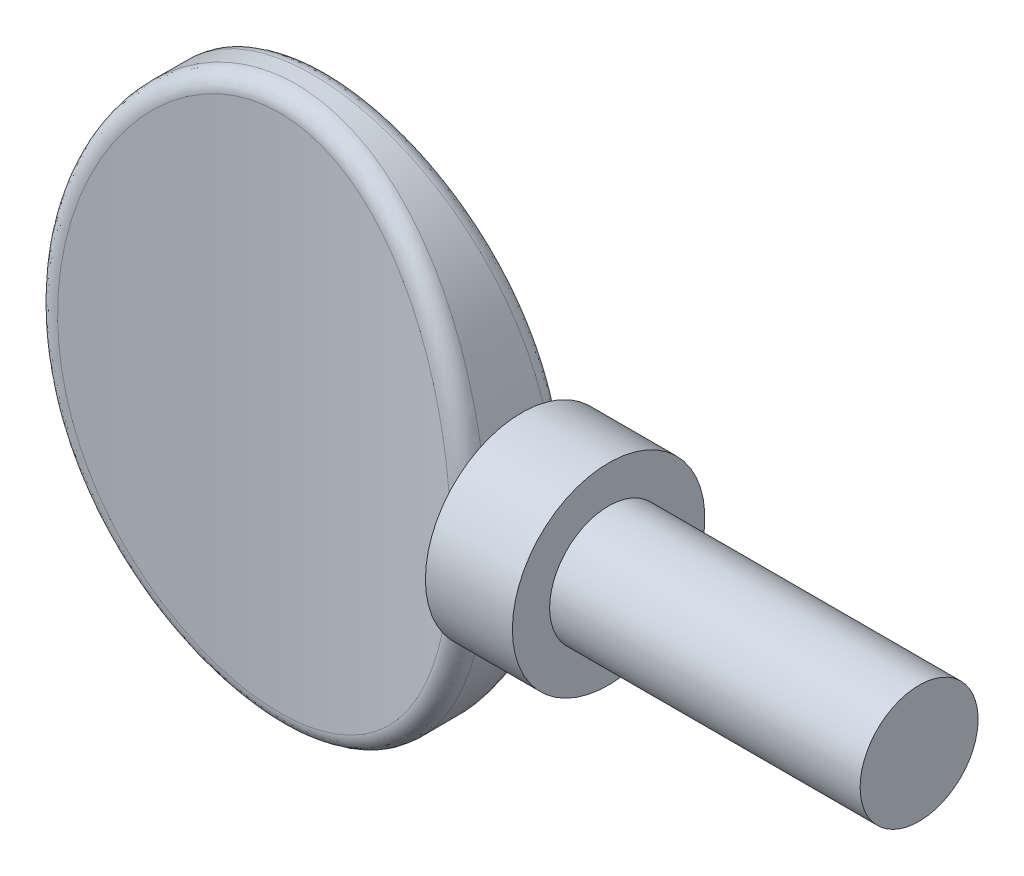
ISO-10303-21;
HEADER;
FILE_DESCRIPTION(('STEP AP214'),'2;1');
FILE_NAME('part.step','',(''),(''),'','','');
FILE_SCHEMA(('AUTOMOTIVE_DESIGN { 1 0 10303 214 1 1 1 1 }'));
ENDSEC;
DATA;
#1=APPLICATION_CONTEXT('core data for automotive mechanical design processes');
#2=APPLICATION_PROTOCOL_DEFINITION('international standard','automotive_design',2000,#1);
#3=PRODUCT_CONTEXT('',#1,'mechanical');
#4=PRODUCT('Part','Part','',(#3));
#5=PRODUCT_RELATED_PRODUCT_CATEGORY('part','',(#4));
#6=PRODUCT_DEFINITION_FORMATION('','',#4);
#7=PRODUCT_DEFINITION_CONTEXT('part definition',#1,'design');
#8=PRODUCT_DEFINITION('design','',#6,#7);
#9=PRODUCT_DEFINITION_SHAPE('','',#8);
#10=(LENGTH_UNIT() NAMED_UNIT(*) SI_UNIT(.MILLI.,.METRE.));
#11=(NAMED_UNIT(*) PLANE_ANGLE_UNIT() SI_UNIT($,.RADIAN.));
#12=(NAMED_UNIT(*) SI_UNIT($,.STERADIAN.) SOLID_ANGLE_UNIT());
#13=UNCERTAINTY_MEASURE_WITH_UNIT(LENGTH_MEASURE(1.E-05),#10,'distance_accuracy_value','');
#14=(GEOMETRIC_REPRESENTATION_CONTEXT(3) GLOBAL_UNCERTAINTY_ASSIGNED_CONTEXT((#13)) GLOBAL_UNIT_ASSIGNED_CONTEXT((#10,
#11,#12)) REPRESENTATION_CONTEXT('',''));
#15=CARTESIAN_POINT('',(0.,0.,0.));
#16=DIRECTION('',(0.,0.,1.));
#17=DIRECTION('',(1.,0.,0.));
#18=AXIS2_PLACEMENT_3D('',#15,#16,#17);
#19=CARTESIAN_POINT('',(0.,0.,2.286));
#20=DIRECTION('',(0.,0.,1.));
#21=DIRECTION('',(0.,1.,0.));
#22=AXIS2_PLACEMENT_3D('',#19,#20,#21);
#23=ELLIPSE('',#22,11.303,8.89);
#24=DIRECTION('',(0.,0.,-1.));
#25=VECTOR('',#24,1.);
#26=SURFACE_OF_LINEAR_EXTRUSION('',#23,#25);
#27=CARTESIAN_POINT('',(8.65241868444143,-2.59563035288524,1.41565744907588));
#28=CARTESIAN_POINT('',(8.64505380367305,-2.63527789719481,1.31316697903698));
#29=CARTESIAN_POINT('',(8.63830595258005,-2.67071705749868,1.20899028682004));
#30=CARTESIAN_POINT('',(8.62627848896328,-2.732857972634,0.997954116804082));
#31=CARTESIAN_POINT('',(8.6209992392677,-2.75955756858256,0.891093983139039));
#32=CARTESIAN_POINT('',(8.61214578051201,-2.8038850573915,0.675401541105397));
#33=CARTESIAN_POINT('',(8.60857205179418,-2.82151039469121,0.566568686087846));
#34=CARTESIAN_POINT('',(8.60328452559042,-2.84746342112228,0.347770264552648));
#35=CARTESIAN_POINT('',(8.60157044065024,-2.85579254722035,0.23780487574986));
#36=CARTESIAN_POINT('',(8.60008413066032,-2.86301911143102,0.018538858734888));
#37=CARTESIAN_POINT('',(8.60029463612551,-2.86200042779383,-0.0907588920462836));
#38=CARTESIAN_POINT('',(8.60260692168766,-2.8507444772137,-0.308858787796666));
#39=CARTESIAN_POINT('',(8.60470870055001,-2.8405072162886,-0.417660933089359));
#40=CARTESIAN_POINT('',(8.61070632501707,-2.810972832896,-0.633744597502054));
#41=CARTESIAN_POINT('',(8.61459849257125,-2.79169428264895,-0.741028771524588));
#42=CARTESIAN_POINT('',(8.62400975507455,-2.74432029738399,-0.953510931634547));
#43=CARTESIAN_POINT('',(8.62952797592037,-2.71622959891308,-1.05871000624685));
#44=CARTESIAN_POINT('',(8.63844994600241,-2.66982167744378,-1.20771767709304));
#45=CARTESIAN_POINT('',(8.64128872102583,-2.65493954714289,-1.25265626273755));
#46=CARTESIAN_POINT('',(8.64720516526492,-2.62361466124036,-1.34191094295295));
#47=CARTESIAN_POINT('',(8.65028255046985,-2.60717375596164,-1.3862277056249));
#48=CARTESIAN_POINT('',(8.65346985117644,-2.58995946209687,-1.43023949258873));
#49=B_SPLINE_CURVE_WITH_KNOTS('',3,(#27,#28,#29,#30,#31,#32,#33,#34,#35,#36,#37,#38,#39,#40,#41,
#42,#43,#44,#45,#46,#47,#48),.UNSPECIFIED.,.F.,.F.,(4,2,2,2,2,2,2,2,2,2,4),(0.,
0.330340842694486,0.660763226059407,0.991278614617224,1.3217429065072,1.64924484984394,
1.97674657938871,2.30357849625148,2.63023504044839,2.772481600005,2.91456137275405),.UNSPECIFIED.);
#50=CARTESIAN_POINT('',(8.64686129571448,-2.62539678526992,1.33619092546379));
#51=VERTEX_POINT('',#50);
#52=CARTESIAN_POINT('',(8.64686129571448,-2.62539678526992,-1.33619092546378));
#53=VERTEX_POINT('',#52);
#54=EDGE_CURVE('E95',#51,#53,#49,.T.);
#55=ORIENTED_EDGE('',*,*,#54,.F.);
#56=CARTESIAN_POINT('',(7.82629564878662,2.4351042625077,1.99569619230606));
#57=CARTESIAN_POINT('',(8.65245132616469,2.59576258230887,2.20582536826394));
#58=CARTESIAN_POINT('',(8.65956685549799,2.55680519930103,1.33926304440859));
#59=CARTESIAN_POINT('',(7.94743912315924,1.75770532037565,2.02649942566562));
#60=CARTESIAN_POINT('',(8.78692406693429,1.87112905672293,2.24349586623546));
#61=CARTESIAN_POINT('',(8.78960914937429,1.8448432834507,1.37072341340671));
#62=CARTESIAN_POINT('',(8.01716971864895,1.07004055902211,2.0448717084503));
#63=CARTESIAN_POINT('',(8.86351312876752,1.1404733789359,2.26573738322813));
#64=CARTESIAN_POINT('',(8.86432478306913,1.12299912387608,1.38948763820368));
#65=CARTESIAN_POINT('',(8.0547289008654,-0.309351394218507,2.05469325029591));
#66=CARTESIAN_POINT('',(8.90506846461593,-0.330332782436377,2.27771295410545));
#67=CARTESIAN_POINT('',(8.90458477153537,-0.324674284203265,1.399518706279));
#68=CARTESIAN_POINT('',(8.02243825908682,-1.00108239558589,2.04611100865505));
#69=CARTESIAN_POINT('',(8.86961883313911,-1.06541121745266,2.26732632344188));
#70=CARTESIAN_POINT('',(8.87000139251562,-1.05050720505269,1.39075337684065));
#71=CARTESIAN_POINT('',(7.89401839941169,-2.05341820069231,2.01297572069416));
#72=CARTESIAN_POINT('',(8.7273712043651,-2.18848798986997,2.22688533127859));
#73=CARTESIAN_POINT('',(8.7322517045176,-2.15566998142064,1.35691120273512));
#74=CARTESIAN_POINT('',(7.83428558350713,-2.41932216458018,1.99763575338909));
#75=CARTESIAN_POINT('',(8.66147254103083,-2.57804176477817,2.20823888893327));
#76=CARTESIAN_POINT('',(8.66816384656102,-2.54012241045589,1.34124398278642));
#77=CARTESIAN_POINT('',(7.68487396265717,-3.14447608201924,1.95997275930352));
#78=CARTESIAN_POINT('',(8.49634767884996,-3.35051128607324,2.16238668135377));
#79=CARTESIAN_POINT('',(8.50770464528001,-3.302633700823,1.30277751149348));
#80=CARTESIAN_POINT('',(7.59519051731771,-3.50372499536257,1.93764865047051));
#81=CARTESIAN_POINT('',(8.39743269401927,-3.73273694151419,2.13526405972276));
#82=CARTESIAN_POINT('',(8.41132829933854,-3.68069156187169,1.27997715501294));
#83=CARTESIAN_POINT('',(7.38556781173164,-4.21216799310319,1.88675959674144));
#84=CARTESIAN_POINT('',(8.16589203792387,-4.48682518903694,2.07336294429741));
#85=CARTESIAN_POINT('',(8.18576943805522,-4.42707064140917,1.22800246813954));
#86=CARTESIAN_POINT('',(7.26565071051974,-4.56136923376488,1.8581992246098));
#87=CARTESIAN_POINT('',(8.0337174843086,-4.85809981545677,2.03869510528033));
#88=CARTESIAN_POINT('',(8.05661094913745,-4.79539877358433,1.19883280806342));
#89=CARTESIAN_POINT('',(6.995124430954,-5.2464697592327,1.79585403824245));
#90=CARTESIAN_POINT('',(7.73510821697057,-5.5867008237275,1.96294144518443));
#91=CARTESIAN_POINT('',(7.76473855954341,-5.51911593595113,1.13515759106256));
#92=CARTESIAN_POINT('',(6.84452615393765,-5.58237371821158,1.76207108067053));
#93=CARTESIAN_POINT('',(7.56920233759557,-5.94356882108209,1.92197039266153));
#94=CARTESIAN_POINT('',(7.60203657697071,-5.87450950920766,1.10065393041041));
#95=CARTESIAN_POINT('',(6.43324199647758,-6.39240336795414,1.67357133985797));
#96=CARTESIAN_POINT('',(7.1165122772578,-6.80243787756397,1.81477728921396));
#97=CARTESIAN_POINT('',(7.15675137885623,-6.73320066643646,1.01026619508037));
#98=CARTESIAN_POINT('',(6.15417610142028,-6.85676635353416,1.61651047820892));
#99=CARTESIAN_POINT('',(6.80972916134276,-7.29531731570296,1.74570436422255));
#100=CARTESIAN_POINT('',(6.85386362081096,-7.22695535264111,0.951988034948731));
#101=CARTESIAN_POINT('',(5.52696453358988,-7.73305703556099,1.49913786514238));
#102=CARTESIAN_POINT('',(6.11796499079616,-8.22578037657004,1.60333969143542));
#103=CARTESIAN_POINT('',(6.17012522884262,-8.16227422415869,0.832111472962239));
#104=CARTESIAN_POINT('',(5.1789299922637,-8.14506735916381,1.43883145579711));
#105=CARTESIAN_POINT('',(5.73502064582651,-8.66343687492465,1.53025899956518));
#106=CARTESIAN_POINT('',(5.78939998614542,-8.60392057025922,0.770518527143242));
#107=CARTESIAN_POINT('',(4.49456535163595,-8.81832678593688,1.33426170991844));
#108=CARTESIAN_POINT('',(4.97849314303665,-9.37945459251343,1.4032069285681));
#109=CARTESIAN_POINT('',(5.0366311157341,-9.32899377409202,0.663717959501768));
#110=CARTESIAN_POINT('',(4.17119435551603,-9.09305461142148,1.28929359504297));
#111=CARTESIAN_POINT('',(4.62171828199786,-9.67163474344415,1.34859286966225));
#112=CARTESIAN_POINT('',(4.67963160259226,-9.62615608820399,0.617790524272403));
#113=CARTESIAN_POINT('',(3.65633336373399,-9.46244525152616,1.22675958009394));
#114=CARTESIAN_POINT('',(4.05119027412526,-10.0652330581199,1.27244557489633));
#115=CARTESIAN_POINT('',(4.10859190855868,-10.0272910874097,0.553922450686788));
#116=CARTESIAN_POINT('',(3.47966977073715,-9.5784960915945,1.2067276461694));
#117=CARTESIAN_POINT('',(3.85593810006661,-10.1886210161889,1.24810451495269));
#118=CARTESIAN_POINT('',(3.91223716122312,-10.1536091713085,0.533463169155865));
#119=CARTESIAN_POINT('',(3.11708209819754,-9.79472651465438,1.16885648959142));
#120=CARTESIAN_POINT('',(3.45504248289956,-10.4184405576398,1.20209344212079));
#121=CARTESIAN_POINT('',(3.50833839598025,-10.3894449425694,0.494784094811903));
#122=CARTESIAN_POINT('',(2.93116240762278,-9.89491352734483,1.15101624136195));
#123=CARTESIAN_POINT('',(3.2493632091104,-10.5250344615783,1.18039540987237));
#124=CARTESIAN_POINT('',(3.30079967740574,-10.4989704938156,0.476563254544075));
#125=CARTESIAN_POINT('',(2.54905941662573,-10.0787208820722,1.11790469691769));
#126=CARTESIAN_POINT('',(2.82653251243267,-10.7204996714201,1.14013561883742));
#127=CARTESIAN_POINT('',(2.87336447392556,-10.7002891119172,0.442745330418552));
#128=CARTESIAN_POINT('',(2.35279103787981,-10.162162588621,1.10266133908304));
#129=CARTESIAN_POINT('',(2.60916890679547,-10.8093536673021,1.12157484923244));
#130=CARTESIAN_POINT('',(2.65336386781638,-10.7918907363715,0.427176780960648));
#131=CARTESIAN_POINT('',(1.95321853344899,-10.3095327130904,1.0755046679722));
#132=CARTESIAN_POINT('',(2.16659574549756,-10.9661742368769,1.08852563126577));
#133=CARTESIAN_POINT('',(2.20463537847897,-10.9539332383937,0.399440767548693));
#134=CARTESIAN_POINT('',(1.74991833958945,-10.3734718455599,1.06358952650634));
#135=CARTESIAN_POINT('',(1.94121514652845,-11.0343149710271,1.07400206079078));
#136=CARTESIAN_POINT('',(1.97591236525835,-11.0243857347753,0.387271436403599));
#137=CARTESIAN_POINT('',(1.33807057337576,-10.4804542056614,1.04353897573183));
#138=CARTESIAN_POINT('',(1.48468245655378,-11.1482227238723,1.04958182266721));
#139=CARTESIAN_POINT('',(1.51188091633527,-11.1424052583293,0.366793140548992));
#140=CARTESIAN_POINT('',(1.12952697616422,-10.5235127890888,1.03540078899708));
#141=CARTESIAN_POINT('',(1.2532927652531,-11.1941423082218,1.03965311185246));
#142=CARTESIAN_POINT('',(1.27657745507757,-11.1899891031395,0.358481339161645));
#143=CARTESIAN_POINT('',(0.709126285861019,-10.5877622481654,1.02322405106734));
#144=CARTESIAN_POINT('',(0.787001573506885,-11.2625799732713,1.02481403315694));
#145=CARTESIAN_POINT('',(0.8017907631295,-11.2610341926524,0.346044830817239));
#146=CARTESIAN_POINT('',(0.49726981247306,-10.6089571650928,1.01918474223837));
#147=CARTESIAN_POINT('',(0.55180519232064,-11.2851925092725,1.0198833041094));
#148=CARTESIAN_POINT('',(0.562308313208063,-11.2844998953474,0.341919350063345));
#149=CARTESIAN_POINT('',(0.105050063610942,-10.627432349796,1.01566371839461));
#150=CARTESIAN_POINT('',(0.116614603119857,-11.3048795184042,1.01559044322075));
#151=CARTESIAN_POINT('',(0.118812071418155,-11.304954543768,0.338323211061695));
#152=CARTESIAN_POINT('',(-0.0751715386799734,-10.6278758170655,1.01557916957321));
#153=CARTESIAN_POINT('',(-0.0834564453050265,-11.3053519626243,1.01548738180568));
#154=CARTESIAN_POINT('',(-0.0850214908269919,-11.3054455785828,0.338236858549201));
#155=CARTESIAN_POINT('',(-0.434937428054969,-10.6127090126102,1.01846977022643));
#156=CARTESIAN_POINT('',(-0.482622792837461,-11.2891920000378,1.01901126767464));
#157=CARTESIAN_POINT('',(-0.491831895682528,-11.2886536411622,0.341189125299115));
#158=CARTESIAN_POINT('',(-0.614481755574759,-10.5970997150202,1.02144473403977));
#159=CARTESIAN_POINT('',(-0.681915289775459,-11.2725446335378,1.0226414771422));
#160=CARTESIAN_POINT('',(-0.694808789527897,-11.2713717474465,0.34422755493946));
#161=CARTESIAN_POINT('',(-0.971475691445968,-10.5501136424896,1.03036356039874));
#162=CARTESIAN_POINT('',(-1.0779135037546,-11.2224918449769,1.03351143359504));
#163=CARTESIAN_POINT('',(-1.0981231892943,-11.2193981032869,0.353336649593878));
#164=CARTESIAN_POINT('',(-1.14892554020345,-10.5187386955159,1.03630707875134));
#165=CARTESIAN_POINT('',(-1.27480360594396,-11.1890405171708,1.04076111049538));
#166=CARTESIAN_POINT('',(-1.29846099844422,-11.1847083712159,0.359406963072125));
#167=CARTESIAN_POINT('',(-1.50046734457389,-10.4407724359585,1.05098693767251));
#168=CARTESIAN_POINT('',(-1.66458038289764,-11.1060123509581,1.05864455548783));
#169=CARTESIAN_POINT('',(-1.69492269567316,-11.0986163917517,0.374399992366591));
#170=CARTESIAN_POINT('',(-1.6745592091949,-10.3941807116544,1.05972335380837));
#171=CARTESIAN_POINT('',(-1.85762658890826,-11.056361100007,1.06929413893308));
#172=CARTESIAN_POINT('',(-1.89104646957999,-11.047213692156,0.383322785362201));
#173=CARTESIAN_POINT('',(-2.01159554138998,-10.2886238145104,1.07935663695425));
#174=CARTESIAN_POINT('',(-2.23106714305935,-10.9440082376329,1.09319591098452));
#175=CARTESIAN_POINT('',(-2.27021161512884,-10.9309431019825,0.403374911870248));
#176=CARTESIAN_POINT('',(-2.17471076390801,-10.2302066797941,1.0901569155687));
#177=CARTESIAN_POINT('',(-2.4117997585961,-10.8817955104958,1.10635018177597));
#178=CARTESIAN_POINT('',(-2.45346562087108,-10.8666726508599,0.414405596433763));
#179=CARTESIAN_POINT('',(-2.4959633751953,-10.1008201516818,1.11384924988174));
#180=CARTESIAN_POINT('',(-2.76753136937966,-10.744137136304,1.13517612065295));
#181=CARTESIAN_POINT('',(-2.81382794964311,-10.7245661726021,0.438603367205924));
#182=CARTESIAN_POINT('',(-2.6540991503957,-10.0298467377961,1.12674197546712));
#183=CARTESIAN_POINT('',(-2.94261127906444,-10.6685976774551,1.15086640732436));
#184=CARTESIAN_POINT('',(-2.99093428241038,-10.6467258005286,0.451771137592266));
#185=CARTESIAN_POINT('',(-3.11989632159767,-9.79942559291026,1.16812424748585));
#186=CARTESIAN_POINT('',(-3.45909560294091,-10.4230523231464,1.20128501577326));
#187=CARTESIAN_POINT('',(-3.51173172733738,-10.394478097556,0.494036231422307));
#188=CARTESIAN_POINT('',(-3.41911154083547,-9.62242439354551,1.19932790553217));
#189=CARTESIAN_POINT('',(-3.79004687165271,-10.2345494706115,1.23926399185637));
#190=CARTESIAN_POINT('',(-3.84508579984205,-10.20128606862,0.52590556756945));
#191=CARTESIAN_POINT('',(-4.09904643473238,-9.15457953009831,1.27920788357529));
#192=CARTESIAN_POINT('',(-4.54276316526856,-9.7366002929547,1.33643019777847));
#193=CARTESIAN_POINT('',(-4.59999386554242,-9.69271674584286,0.607489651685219));
#194=CARTESIAN_POINT('',(-4.4677733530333,-8.84600074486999,1.33002831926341));
#195=CARTESIAN_POINT('',(-4.94952770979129,-9.40827652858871,1.39816929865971));
#196=CARTESIAN_POINT('',(-5.00720170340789,-9.35876546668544,0.659394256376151));
#197=CARTESIAN_POINT('',(-5.1506512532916,-8.17151649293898,1.43465606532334));
#198=CARTESIAN_POINT('',(-5.70311367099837,-8.69214633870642,1.52508390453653));
#199=CARTESIAN_POINT('',(-5.75825220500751,-8.63243872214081,0.766254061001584));
#200=CARTESIAN_POINT('',(-5.46469809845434,-7.80550411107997,1.48846882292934));
#201=CARTESIAN_POINT('',(-6.04883115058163,-8.30338280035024,1.59030661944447));
#202=CARTESIAN_POINT('',(-6.10197403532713,-8.23995436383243,0.821214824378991));
#203=CARTESIAN_POINT('',(-6.11532335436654,-6.92506403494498,1.6082879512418));
#204=CARTESIAN_POINT('',(-6.76780893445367,-7.36679603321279,1.7359003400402));
#205=CARTESIAN_POINT('',(-6.81177427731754,-7.29951289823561,0.943590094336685));
#206=CARTESIAN_POINT('',(-6.43476934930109,-6.39735552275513,1.67362664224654));
#207=CARTESIAN_POINT('',(-7.11866978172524,-6.80670608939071,1.81495566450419));
#208=CARTESIAN_POINT('',(-7.15847428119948,-6.73831516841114,1.01032267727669));
#209=CARTESIAN_POINT('',(-6.98586982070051,-5.29504721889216,1.79279155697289));
#210=CARTESIAN_POINT('',(-7.72672939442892,-5.63515267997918,1.95964859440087));
#211=CARTESIAN_POINT('',(-7.75498793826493,-5.57007516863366,1.13202977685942));
#212=CARTESIAN_POINT('',(-7.21743550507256,-4.72040071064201,1.84660611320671));
#213=CARTESIAN_POINT('',(-7.98107986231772,-5.02517153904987,2.02476167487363));
#214=CARTESIAN_POINT('',(-8.00470360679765,-4.96298727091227,1.18699237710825));
#215=CARTESIAN_POINT('',(-7.59788704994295,-3.53286241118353,1.93787390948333));
#216=CARTESIAN_POINT('',(-8.40127783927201,-3.76125290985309,2.13576419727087));
#217=CARTESIAN_POINT('',(-8.41432758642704,-3.71108875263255,1.28020721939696));
#218=CARTESIAN_POINT('',(-7.74551320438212,-2.91953395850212,1.97507615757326));
#219=CARTESIAN_POINT('',(-8.56353360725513,-3.10968614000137,2.18081781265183));
#220=CARTESIAN_POINT('',(-8.572867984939,-3.06585606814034,1.31820311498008));
#221=CARTESIAN_POINT('',(-7.95444111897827,-1.67779030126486,2.02838222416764));
#222=CARTESIAN_POINT('',(-8.79452477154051,-1.78651139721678,2.24575202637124));
#223=CARTESIAN_POINT('',(-8.79710310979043,-1.76097068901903,1.37264637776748));
#224=CARTESIAN_POINT('',(-8.01589074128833,-1.04940282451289,2.04452217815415));
#225=CARTESIAN_POINT('',(-8.86213168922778,-1.11847428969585,2.26532120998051));
#226=CARTESIAN_POINT('',(-8.86295686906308,-1.10134467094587,1.38913065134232));
#227=CARTESIAN_POINT('',(-8.04339962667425,-0.134428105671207,2.05173737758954));
#228=CARTESIAN_POINT('',(-8.89250870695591,-0.143244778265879,2.27410147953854));
#229=CARTESIAN_POINT('',(-8.89243947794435,-0.141070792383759,1.39649977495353));
#230=CARTESIAN_POINT('',(-8.04322422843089,0.151433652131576,2.05168672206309));
#231=CARTESIAN_POINT('',(-8.89232438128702,0.161377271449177,2.2740424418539));
#232=CARTESIAN_POINT('',(-8.8922524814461,0.158917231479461,1.39644803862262));
#233=CARTESIAN_POINT('',(-8.02535656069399,0.722706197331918,2.04701032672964));
#234=CARTESIAN_POINT('',(-8.87256700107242,0.770474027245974,2.26834414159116));
#235=CARTESIAN_POINT('',(-8.87310070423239,0.758474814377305,1.39167188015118));
#236=CARTESIAN_POINT('',(-8.00765727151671,1.00811675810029,2.04238275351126));
#237=CARTESIAN_POINT('',(-8.85300951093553,1.07458955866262,2.26270936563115));
#238=CARTESIAN_POINT('',(-8.85412839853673,1.05804415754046,1.3869455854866));
#239=CARTESIAN_POINT('',(-7.947886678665,1.6500558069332,2.02685880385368));
#240=CARTESIAN_POINT('',(-8.78692419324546,1.75875334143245,2.24379627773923));
#241=CARTESIAN_POINT('',(-8.79003704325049,1.73201243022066,1.37109045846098));
#242=CARTESIAN_POINT('',(-7.90073256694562,2.00606858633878,2.01465999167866));
#243=CARTESIAN_POINT('',(-8.73487578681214,2.1378622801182,2.22895949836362));
#244=CARTESIAN_POINT('',(-8.73946402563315,2.10591711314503,1.35863140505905));
#245=CARTESIAN_POINT('',(-7.77848949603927,2.71274841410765,1.98351195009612));
#246=CARTESIAN_POINT('',(-8.5997385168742,2.89083812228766,2.19102428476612));
#247=CARTESIAN_POINT('',(-8.6082550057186,2.84858479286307,1.3268188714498));
#248=CARTESIAN_POINT('',(-7.70339994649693,3.063415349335,1.9645625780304));
#249=CARTESIAN_POINT('',(-8.51689426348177,3.26405432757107,2.16799271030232));
#250=CARTESIAN_POINT('',(-8.52761836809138,3.21734768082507,1.30746524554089));
#251=CARTESIAN_POINT('',(-7.52482874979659,3.75734261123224,1.92045005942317));
#252=CARTESIAN_POINT('',(-8.3196020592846,4.00293869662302,2.11431336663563));
#253=CARTESIAN_POINT('',(-8.33564394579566,3.94777946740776,1.26241165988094));
#254=CARTESIAN_POINT('',(-7.42130346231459,4.10059067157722,1.89527736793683));
#255=CARTESIAN_POINT('',(-8.20545267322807,4.36801638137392,2.0837427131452));
#256=CARTESIAN_POINT('',(-8.22425897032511,4.30943653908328,1.23670195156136));
#257=CARTESIAN_POINT('',(-7.18557888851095,4.77601163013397,1.83956259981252));
#258=CARTESIAN_POINT('',(-7.94517850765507,5.08660176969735,2.01601312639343));
#259=CARTESIAN_POINT('',(-7.97026371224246,5.02200340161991,1.17979860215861));
#260=CARTESIAN_POINT('',(-7.05338947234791,5.10818829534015,1.80902237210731));
#261=CARTESIAN_POINT('',(-7.79950129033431,5.43963428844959,1.97895746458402));
#262=CARTESIAN_POINT('',(-7.8276641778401,5.37291684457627,1.14860684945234));
#263=CARTESIAN_POINT('',(-6.67495246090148,5.94632514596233,1.72466643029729));
#264=CARTESIAN_POINT('',(-7.38297359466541,6.32842399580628,1.8767643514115));
#265=CARTESIAN_POINT('',(-7.4186740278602,6.25981775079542,1.06245131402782));
#266=CARTESIAN_POINT('',(-6.40690462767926,6.44195824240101,1.66758899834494));
#267=CARTESIAN_POINT('',(-7.08838989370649,6.8544708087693,1.80768456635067));
#268=CARTESIAN_POINT('',(-7.12833321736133,6.78575428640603,1.00415623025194));
#269=CARTESIAN_POINT('',(-5.79654461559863,7.38178409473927,1.54807423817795));
#270=CARTESIAN_POINT('',(-6.41517877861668,7.85259495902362,1.66268974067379));
#271=CARTESIAN_POINT('',(-6.46441231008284,7.78670698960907,0.882091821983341));
#272=CARTESIAN_POINT('',(-5.45436166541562,7.82606432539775,1.48564634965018));
#273=CARTESIAN_POINT('',(-6.03887887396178,8.32439730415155,1.58707563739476));
#274=CARTESIAN_POINT('',(-6.09097702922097,8.26180964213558,0.81833213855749));
#275=CARTESIAN_POINT('',(-4.77789167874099,8.55448470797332,1.37612062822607));
#276=CARTESIAN_POINT('',(-5.29119543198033,9.09910698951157,1.45400801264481));
#277=CARTESIAN_POINT('',(-5.34869298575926,9.04439141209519,0.70646986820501));
#278=CARTESIAN_POINT('',(-4.45799420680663,8.85245688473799,1.32863499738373));
#279=CARTESIAN_POINT('',(-4.93851328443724,9.41585809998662,1.39637707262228));
#280=CARTESIAN_POINT('',(-4.99642235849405,9.36587548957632,0.65797121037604));
#281=CARTESIAN_POINT('',(-3.77461012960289,9.39190551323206,1.23929408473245));
#282=CARTESIAN_POINT('',(-4.18378611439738,9.98880971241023,1.2879446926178));
#283=CARTESIAN_POINT('',(-4.24030383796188,9.95027102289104,0.566724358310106));
#284=CARTESIAN_POINT('',(-3.41117328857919,9.63344555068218,1.19743248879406));
#285=CARTESIAN_POINT('',(-3.78213052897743,10.2460992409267,1.237002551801));
#286=CARTESIAN_POINT('',(-3.83651479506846,10.2132483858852,0.523969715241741));
#287=CARTESIAN_POINT('',(-2.7071131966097,10.0130852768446,1.12997552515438));
#288=CARTESIAN_POINT('',(-3.00265612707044,10.6500345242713,1.15495053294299));
#289=CARTESIAN_POINT('',(-3.05059237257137,10.6281650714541,0.455073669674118));
#290=CARTESIAN_POINT('',(-2.37204630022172,10.1615243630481,1.10285226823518));
#291=CARTESIAN_POINT('',(-2.63139042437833,10.8083853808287,1.12186903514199));
#292=CARTESIAN_POINT('',(-2.67521894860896,10.7911098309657,0.427371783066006));
#293=CARTESIAN_POINT('',(-1.85473120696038,10.3404490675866,1.06974582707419));
#294=CARTESIAN_POINT('',(-2.05733540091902,10.9991414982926,1.08150227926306));
#295=CARTESIAN_POINT('',(-2.09383679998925,10.9879949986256,0.393559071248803));
#296=CARTESIAN_POINT('',(-1.67979337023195,10.3928095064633,1.05997187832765));
#297=CARTESIAN_POINT('',(-1.86339026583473,11.0549303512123,1.06959065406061));
#298=CARTESIAN_POINT('',(-1.89693593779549,11.045710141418,0.383576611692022));
#299=CARTESIAN_POINT('',(-1.32608818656,10.4821521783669,1.04321230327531));
#300=CARTESIAN_POINT('',(-1.47128411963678,11.1500600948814,1.04917741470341));
#301=CARTESIAN_POINT('',(-1.49833774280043,11.1442889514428,0.366459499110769));
#302=CARTESIAN_POINT('',(-1.14732240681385,10.5191405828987,1.03622555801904));
#303=CARTESIAN_POINT('',(-1.27297000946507,11.1894916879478,1.04065670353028));
#304=CARTESIAN_POINT('',(-1.29664236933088,11.1851593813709,0.359323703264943));
#305=CARTESIAN_POINT('',(-0.786475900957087,10.5772111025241,1.02522674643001));
#306=CARTESIAN_POINT('',(-0.872750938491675,11.2513466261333,1.0272534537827));
#307=CARTESIAN_POINT('',(-0.8891721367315,11.2493631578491,0.348090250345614));
#308=CARTESIAN_POINT('',(-0.604384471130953,10.5982263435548,1.02122718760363));
#309=CARTESIAN_POINT('',(-0.670646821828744,11.2737587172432,1.02237324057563));
#310=CARTESIAN_POINT('',(-0.683383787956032,11.2726227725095,0.344005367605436));
#311=CARTESIAN_POINT('',(-0.239046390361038,10.6237097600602,1.01637444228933));
#312=CARTESIAN_POINT('',(-0.265317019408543,11.3009091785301,1.01645776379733));
#313=CARTESIAN_POINT('',(-0.270347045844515,11.3008314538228,0.339049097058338));
#314=CARTESIAN_POINT('',(-0.0557997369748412,10.6281779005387,1.01552126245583));
#315=CARTESIAN_POINT('',(-0.0618866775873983,11.3056751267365,1.01541649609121));
#316=CARTESIAN_POINT('',(-0.0630986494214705,11.3057804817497,0.338177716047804));
#317=CARTESIAN_POINT('',(0.310342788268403,10.6204795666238,1.01698891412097));
#318=CARTESIAN_POINT('',(0.344362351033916,11.2974728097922,1.01720566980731));
#319=CARTESIAN_POINT('',(0.350954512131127,11.2972566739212,0.339676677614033));
#320=CARTESIAN_POINT('',(0.493238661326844,10.6083131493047,1.0193097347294));
#321=CARTESIAN_POINT('',(0.547389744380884,11.2844961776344,1.02003793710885));
#322=CARTESIAN_POINT('',(0.557759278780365,11.2837839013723,0.342047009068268));
#323=CARTESIAN_POINT('',(0.857193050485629,10.5675786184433,1.02705146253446));
#324=CARTESIAN_POINT('',(0.951137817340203,11.2411005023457,1.02947400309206));
#325=CARTESIAN_POINT('',(0.969049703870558,11.2387130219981,0.349953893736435));
#326=CARTESIAN_POINT('',(1.03825162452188,10.5390110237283,1.03247227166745));
#327=CARTESIAN_POINT('',(1.15205642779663,11.2106386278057,1.03608708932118));
#328=CARTESIAN_POINT('',(1.17353543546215,11.2071154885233,0.355490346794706));
#329=CARTESIAN_POINT('',(1.38577241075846,10.4683102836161,1.04581044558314));
#330=CARTESIAN_POINT('',(1.53738746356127,11.1353476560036,1.05233647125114));
#331=CARTESIAN_POINT('',(1.56562555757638,11.1290138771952,0.36911306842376));
#332=CARTESIAN_POINT('',(1.55243251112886,10.4271514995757,1.05354783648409));
#333=CARTESIAN_POINT('',(1.72221209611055,11.0914846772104,1.06176887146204));
#334=CARTESIAN_POINT('',(1.75347855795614,11.0835813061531,0.377015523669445));
#335=CARTESIAN_POINT('',(1.88194456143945,10.3315323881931,1.07139376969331));
#336=CARTESIAN_POINT('',(2.08740434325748,10.9896901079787,1.08349994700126));
#337=CARTESIAN_POINT('',(2.12443081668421,10.9781855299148,0.395242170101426));
#338=CARTESIAN_POINT('',(2.0447952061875,10.2770675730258,1.08150311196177));
#339=CARTESIAN_POINT('',(2.26788778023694,10.9316775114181,1.09581547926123));
#340=CARTESIAN_POINT('',(2.30752844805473,10.9182174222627,0.405567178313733));
#341=CARTESIAN_POINT('',(2.52615676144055,10.0948432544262,1.11502540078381));
#342=CARTESIAN_POINT('',(2.80192013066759,10.7374389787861,1.13667911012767));
#343=CARTESIAN_POINT('',(2.84792805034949,10.7179160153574,0.439804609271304));
#344=CARTESIAN_POINT('',(2.83775186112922,9.94819639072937,1.14164376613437));
#345=CARTESIAN_POINT('',(3.14702031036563,10.5810992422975,1.16912176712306));
#346=CARTESIAN_POINT('',(3.19664674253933,10.5571217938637,0.466990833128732));
#347=CARTESIAN_POINT('',(3.46147687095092,9.59774159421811,1.20356654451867));
#348=CARTESIAN_POINT('',(3.83708974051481,10.2084377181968,1.24439518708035));
#349=CARTESIAN_POINT('',(3.89231625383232,10.1744153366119,0.530234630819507));
#350=CARTESIAN_POINT('',(3.77151791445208,9.3902081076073,1.23940741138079));
#351=CARTESIAN_POINT('',(4.17970555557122,9.98753738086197,1.28798248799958));
#352=CARTESIAN_POINT('',(4.23673354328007,9.94854700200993,0.56684010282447));
#353=CARTESIAN_POINT('',(4.35991988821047,8.93336469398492,1.3153767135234));
#354=CARTESIAN_POINT('',(4.82954880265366,9.50230750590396,1.38018944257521));
#355=CARTESIAN_POINT('',(4.88803612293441,9.45342711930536,0.644430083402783));
#356=CARTESIAN_POINT('',(4.63825599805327,8.68402240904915,1.3555084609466));
#357=CARTESIAN_POINT('',(5.1365679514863,9.23728381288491,1.42890183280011));
#358=CARTESIAN_POINT('',(5.19489202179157,9.18414197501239,0.685417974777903));
#359=CARTESIAN_POINT('',(5.2883525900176,8.02265329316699,1.45704370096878));
#360=CARTESIAN_POINT('',(5.8558547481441,8.53323619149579,1.55237909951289));
#361=CARTESIAN_POINT('',(5.90931964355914,8.47252416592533,0.789119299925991));
#362=CARTESIAN_POINT('',(5.64019381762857,7.59026791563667,1.51934813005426));
#363=CARTESIAN_POINT('',(6.24288672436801,8.07397250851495,1.62786734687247));
#364=CARTESIAN_POINT('',(6.29382777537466,8.00948569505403,0.852752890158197));
#365=CARTESIAN_POINT('',(6.27033111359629,6.67225546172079,1.63966575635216));
#366=CARTESIAN_POINT('',(6.93790446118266,7.09909556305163,1.77382186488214));
#367=CARTESIAN_POINT('',(6.98009678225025,7.03057005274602,0.975637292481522));
#368=CARTESIAN_POINT('',(6.54850581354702,6.18654236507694,1.69767175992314));
#369=CARTESIAN_POINT('',(7.2436171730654,6.58356877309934,1.84402554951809));
#370=CARTESIAN_POINT('',(7.28172113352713,6.51460760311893,1.03488075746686));
#371=CARTESIAN_POINT('',(7.03636802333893,5.17052156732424,1.80448690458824));
#372=CARTESIAN_POINT('',(7.7819565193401,5.50356359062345,1.97373871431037));
#373=CARTESIAN_POINT('',(7.80945284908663,5.43850602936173,1.14397462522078));
#374=CARTESIAN_POINT('',(7.24495455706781,4.63964991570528,1.85314346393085));
#375=CARTESIAN_POINT('',(8.01126147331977,4.93984669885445,2.03265655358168));
#376=CARTESIAN_POINT('',(8.03434739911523,4.87781622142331,1.19366919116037));
#377=CARTESIAN_POINT('',(7.5896007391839,3.55324278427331,1.93595435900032));
#378=CARTESIAN_POINT('',(8.39188677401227,3.78362130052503,2.13336693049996));
#379=CARTESIAN_POINT('',(8.40539047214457,3.7326204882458,1.27824671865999));
#380=CARTESIAN_POINT('',(7.72568060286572,2.99771422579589,1.97011273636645));
#381=CARTESIAN_POINT('',(8.54157946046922,3.19321802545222,2.17476629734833));
#382=CARTESIAN_POINT('',(8.55156094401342,3.14812125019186,1.31313380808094));
#383=CARTESIAN_POINT('',(7.82629564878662,2.4351042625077,1.99569619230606));
#384=CARTESIAN_POINT('',(8.65245132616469,2.59576258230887,2.20582536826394));
#385=CARTESIAN_POINT('',(8.65956685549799,2.55680519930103,1.33926304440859));
#386=(BOUNDED_SURFACE() B_SPLINE_SURFACE(3,2,((#56,#57,#58),(#59,#60,#61),(#62,#63,#64),(#65,
#66,#67),(#68,#69,#70),(#71,#72,#73),(#74,#75,#76),(#77,#78,#79),(#80,#81,#82),(#83,#84,#85),
(#86,#87,#88),(#89,#90,#91),(#92,#93,#94),(#95,#96,#97),(#98,#99,#100),(#101,#102,#103),(#104,
#105,#106),(#107,#108,#109),(#110,#111,#112),(#113,#114,#115),(#116,#117,#118),(#119,#120,#121),
(#122,#123,#124),(#125,#126,#127),(#128,#129,#130),(#131,#132,#133),(#134,#135,#136),(#137,#138,
#139),(#140,#141,#142),(#143,#144,#145),(#146,#147,#148),(#149,#150,#151),(#152,#153,#154),
(#155,#156,#157),(#158,#159,#160),(#161,#162,#163),(#164,#165,#166),(#167,#168,#169),(#170,#171,
#172),(#173,#174,#175),(#176,#177,#178),(#179,#180,#181),(#182,#183,#184),(#185,#186,#187),
(#188,#189,#190),(#191,#192,#193),(#194,#195,#196),(#197,#198,#199),(#200,#201,#202),(#203,#204,
#205),(#206,#207,#208),(#209,#210,#211),(#212,#213,#214),(#215,#216,#217),(#218,#219,#220),
(#221,#222,#223),(#224,#225,#226),(#227,#228,#229),(#230,#231,#232),(#233,#234,#235),(#236,#237,
#238),(#239,#240,#241),(#242,#243,#244),(#245,#246,#247),(#248,#249,#250),(#251,#252,#253),
(#254,#255,#256),(#257,#258,#259),(#260,#261,#262),(#263,#264,#265),(#266,#267,#268),(#269,#270,
#271),(#272,#273,#274),(#275,#276,#277),(#278,#279,#280),(#281,#282,#283),(#284,#285,#286),
(#287,#288,#289),(#290,#291,#292),(#293,#294,#295),(#296,#297,#298),(#299,#300,#301),(#302,#303,
#304),(#305,#306,#307),(#308,#309,#310),(#311,#312,#313),(#314,#315,#316),(#317,#318,#319),
(#320,#321,#322),(#323,#324,#325),(#326,#327,#328),(#329,#330,#331),(#332,#333,#334),(#335,#336,
#337),(#338,#339,#340),(#341,#342,#343),(#344,#345,#346),(#347,#348,#349),(#350,#351,#352),
(#353,#354,#355),(#356,#357,#358),(#359,#360,#361),(#362,#363,#364),(#365,#366,#367),(#368,#369,
#370),(#371,#372,#373),(#374,#375,#376),(#377,#378,#379),(#380,#381,#382),(#383,#384,#385)),
.UNSPECIFIED.,.T.,.F.,.F.) B_SPLINE_SURFACE_WITH_KNOTS((4,2,2,2,2,2,2,2,2,2,2,2,2,2,2,2,2,2,2,2,
2,2,2,2,2,2,2,2,2,2,2,2,2,2,2,2,2,2,2,2,2,2,2,2,2,2,2,2,2,2,2,2,2,2,4),(3,3),(0.,
2.06622314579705,4.13486190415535,5.24755247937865,6.36041552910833,7.4724652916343,
8.58412061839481,10.2215277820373,11.8563176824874,13.1469674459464,13.792803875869,
14.4383369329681,15.0904277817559,15.7421597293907,16.3934116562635,17.0445431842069,
17.5960362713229,18.1474958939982,18.6988915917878,19.2503022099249,19.7803937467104,
20.3106553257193,21.3706565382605,22.831692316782,24.295480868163,26.1576819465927,
28.0217595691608,29.9131198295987,31.8012308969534,32.6583453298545,33.5158032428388,
34.5929671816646,35.6701538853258,36.7490030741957,37.8274813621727,39.5282876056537,
41.226152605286,42.5557025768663,43.883747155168,45.0006946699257,45.5594567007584,
46.1179941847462,46.6788573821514,47.2397217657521,47.8005842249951,48.3614289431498,
48.8867331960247,49.4122148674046,50.4623283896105,51.5993275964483,52.737210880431,
54.4254075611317,56.116368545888,57.8329376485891,59.5490279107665),(0.,1.),
.UNSPECIFIED.) GEOMETRIC_REPRESENTATION_ITEM() RATIONAL_B_SPLINE_SURFACE(((1.,0.615432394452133,
1.),(1.,0.61297474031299,1.),(1.,0.611532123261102,1.),(1.,0.610758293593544,1.),(1.,
0.611429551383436,1.),(1.,0.61405591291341,1.),(1.,0.615274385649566,1.),(1.,0.618290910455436,
1.),(1.,0.62008905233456,1.),(1.,0.624233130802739,1.),(1.,0.626578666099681,1.),(1.,
0.631770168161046,1.),(1.,0.634615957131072,1.),(1.,0.642197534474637,1.),(1.,0.647190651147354,
1.),(1.,0.657791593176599,1.),(1.,0.663398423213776,1.),(1.,0.673468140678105,1.),(1.,
0.677923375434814,1.),(1.,0.684287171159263,1.),(1.,0.686356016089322,1.),(1.,0.690317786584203,
1.),(1.,0.692210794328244,1.),(1.,0.695765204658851,1.),(1.,0.697424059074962,1.),(1.,
0.700407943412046,1.),(1.,0.701733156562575,1.),(1.,0.703978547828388,1.),(1.,0.70489902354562,
1.),(1.,0.706281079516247,1.),(1.,0.706742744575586,1.),(1.,0.707145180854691,1.),(1.,
0.707154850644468,1.),(1.,0.706824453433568,1.),(1.,0.706484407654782,1.),(1.,0.705470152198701,
1.),(1.,0.704795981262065,1.),(1.,0.703143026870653,1.),(1.,0.702164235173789,1.),(1.,
0.699984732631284,1.),(1.,0.698794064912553,1.),(1.,0.696208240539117,1.),(1.,0.69481301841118,
1.),(1.,0.6903842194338,1.),(1.,0.6871063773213,1.),(1.,0.678923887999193,1.),(1.,
0.673872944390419,1.),(1.,0.66380350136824,1.),(1.,0.658785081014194,1.),(1.,0.647904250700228,
1.),(1.,0.642183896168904,1.),(1.,0.63199434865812,1.),(1.,0.627526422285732,1.),(1.,
0.620055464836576,1.),(1.,0.617074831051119,1.),(1.,0.612828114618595,1.),(1.,0.611559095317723,
1.),(1.,0.610991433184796,1.),(1.,0.610995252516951,1.),(1.,0.611363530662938,1.),(1.,
0.611728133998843,1.),(1.,0.612954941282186,1.),(1.,0.613920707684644,1.),(1.,0.616403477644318,
1.),(1.,0.617920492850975,1.),(1.,0.621485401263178,1.),(1.,0.623534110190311,1.),(1.,
0.62812384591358,1.),(1.,0.630664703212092,1.),(1.,0.637788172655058,1.),(1.,0.642702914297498,
1.),(1.,0.653321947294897,1.),(1.,0.659024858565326,1.),(1.,0.669395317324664,1.),(1.,
0.674019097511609,1.),(1.,0.68297001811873,1.),(1.,0.687297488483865,1.),(1.,0.694444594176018,
1.),(1.,0.697394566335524,1.),(1.,0.701047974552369,1.),(1.,0.702137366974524,1.),(1.,
0.70401629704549,1.),(1.,0.704805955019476,1.),(1.,0.706053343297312,1.),(1.,0.706509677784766,
1.),(1.,0.707063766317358,1.),(1.,0.707161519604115,1.),(1.,0.706993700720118,1.),(1.,
0.706728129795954,1.),(1.,0.705846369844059,1.),(1.,0.705230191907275,1.),(1.,0.703724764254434,
1.),(1.,0.702855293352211,1.),(1.,0.700866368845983,1.),(1.,0.699746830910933,1.),(1.,
0.696070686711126,1.),(1.,0.693195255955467,1.),(1.,0.686667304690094,1.),(1.,0.682970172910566,
1.),(1.,0.675337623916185,1.),(1.,0.671402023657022,1.),(1.,0.661686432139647,1.),(1.,
0.655934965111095,1.),(1.,0.645145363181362,1.),(1.,0.64010841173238,1.),(1.,0.631022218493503,
1.),(1.,0.626989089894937,1.),(1.,0.620214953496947,1.),(1.,0.617473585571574,1.),(1.,
0.615432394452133,1.))) REPRESENTATION_ITEM('') SURFACE());
#387=CARTESIAN_POINT('',(8.65956685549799,2.55680519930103,1.33926304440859));
#388=CARTESIAN_POINT('',(8.78960914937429,1.8448432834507,1.37072341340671));
#389=CARTESIAN_POINT('',(8.86432478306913,1.12299912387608,1.38948763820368));
#390=CARTESIAN_POINT('',(8.90458477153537,-0.324674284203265,1.399518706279));
#391=CARTESIAN_POINT('',(8.87000139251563,-1.05050720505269,1.39075337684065));
#392=CARTESIAN_POINT('',(8.7322517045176,-2.15566998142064,1.35691120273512));
#393=CARTESIAN_POINT('',(8.66816384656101,-2.54012241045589,1.34124398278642));
#394=CARTESIAN_POINT('',(8.50770464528,-3.302633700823,1.30277751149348));
#395=CARTESIAN_POINT('',(8.41132829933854,-3.68069156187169,1.27997715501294));
#396=CARTESIAN_POINT('',(8.18576943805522,-4.42707064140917,1.22800246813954));
#397=CARTESIAN_POINT('',(8.05661094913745,-4.79539877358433,1.19883280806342));
#398=CARTESIAN_POINT('',(7.76473855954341,-5.51911593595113,1.13515759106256));
#399=CARTESIAN_POINT('',(7.60203657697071,-5.87450950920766,1.10065393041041));
#400=CARTESIAN_POINT('',(7.15675137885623,-6.73320066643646,1.01026619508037));
#401=CARTESIAN_POINT('',(6.85386362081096,-7.22695535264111,0.951988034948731));
#402=CARTESIAN_POINT('',(6.17012522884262,-8.16227422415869,0.832111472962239));
#403=CARTESIAN_POINT('',(5.78939998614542,-8.60392057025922,0.770518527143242));
#404=CARTESIAN_POINT('',(5.0366311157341,-9.32899377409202,0.663717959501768));
#405=CARTESIAN_POINT('',(4.67963160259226,-9.62615608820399,0.617790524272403));
#406=CARTESIAN_POINT('',(4.10859190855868,-10.0272910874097,0.553922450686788));
#407=CARTESIAN_POINT('',(3.91223716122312,-10.1536091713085,0.533463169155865));
#408=CARTESIAN_POINT('',(3.50833839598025,-10.3894449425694,0.494784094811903));
#409=CARTESIAN_POINT('',(3.30079967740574,-10.4989704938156,0.476563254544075));
#410=CARTESIAN_POINT('',(2.87336447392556,-10.7002891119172,0.442745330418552));
#411=CARTESIAN_POINT('',(2.65336386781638,-10.7918907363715,0.427176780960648));
#412=CARTESIAN_POINT('',(2.20463537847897,-10.9539332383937,0.399440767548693));
#413=CARTESIAN_POINT('',(1.97591236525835,-11.0243857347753,0.387271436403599));
#414=CARTESIAN_POINT('',(1.51188091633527,-11.1424052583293,0.366793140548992));
#415=CARTESIAN_POINT('',(1.27657745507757,-11.1899891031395,0.358481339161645));
#416=CARTESIAN_POINT('',(0.801790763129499,-11.2610341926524,0.346044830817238));
#417=CARTESIAN_POINT('',(0.562308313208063,-11.2844998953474,0.341919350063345));
#418=CARTESIAN_POINT('',(0.118812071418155,-11.3049545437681,0.338323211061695));
#419=CARTESIAN_POINT('',(-0.0850214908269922,-11.3054455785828,0.338236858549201));
#420=CARTESIAN_POINT('',(-0.491831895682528,-11.2886536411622,0.341189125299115));
#421=CARTESIAN_POINT('',(-0.694808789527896,-11.2713717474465,0.344227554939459));
#422=CARTESIAN_POINT('',(-1.0981231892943,-11.2193981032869,0.353336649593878));
#423=CARTESIAN_POINT('',(-1.29846099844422,-11.1847083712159,0.359406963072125));
#424=CARTESIAN_POINT('',(-1.69492269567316,-11.0986163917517,0.374399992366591));
#425=CARTESIAN_POINT('',(-1.89104646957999,-11.047213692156,0.383322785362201));
#426=CARTESIAN_POINT('',(-2.27021161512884,-10.9309431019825,0.403374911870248));
#427=CARTESIAN_POINT('',(-2.45346562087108,-10.8666726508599,0.414405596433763));
#428=CARTESIAN_POINT('',(-2.81382794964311,-10.7245661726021,0.438603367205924));
#429=CARTESIAN_POINT('',(-2.99093428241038,-10.6467258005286,0.451771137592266));
#430=CARTESIAN_POINT('',(-3.51173172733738,-10.394478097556,0.494036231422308));
#431=CARTESIAN_POINT('',(-3.84508579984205,-10.20128606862,0.52590556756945));
#432=CARTESIAN_POINT('',(-4.59999386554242,-9.69271674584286,0.607489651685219));
#433=CARTESIAN_POINT('',(-5.00720170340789,-9.35876546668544,0.659394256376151));
#434=CARTESIAN_POINT('',(-5.75825220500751,-8.63243872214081,0.766254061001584));
#435=CARTESIAN_POINT('',(-6.10197403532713,-8.23995436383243,0.821214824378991));
#436=CARTESIAN_POINT('',(-6.81177427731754,-7.29951289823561,0.943590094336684));
#437=CARTESIAN_POINT('',(-7.15847428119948,-6.73831516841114,1.01032267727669));
#438=CARTESIAN_POINT('',(-7.75498793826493,-5.57007516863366,1.13202977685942));
#439=CARTESIAN_POINT('',(-8.00470360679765,-4.96298727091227,1.18699237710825));
#440=CARTESIAN_POINT('',(-8.41432758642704,-3.71108875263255,1.28020721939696));
#441=CARTESIAN_POINT('',(-8.572867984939,-3.06585606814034,1.31820311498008));
#442=CARTESIAN_POINT('',(-8.79710310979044,-1.76097068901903,1.37264637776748));
#443=CARTESIAN_POINT('',(-8.86295686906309,-1.10134467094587,1.38913065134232));
#444=CARTESIAN_POINT('',(-8.89243947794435,-0.141070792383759,1.39649977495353));
#445=CARTESIAN_POINT('',(-8.8922524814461,0.158917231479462,1.39644803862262));
#446=CARTESIAN_POINT('',(-8.87310070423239,0.758474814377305,1.39167188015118));
#447=CARTESIAN_POINT('',(-8.85412839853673,1.05804415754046,1.3869455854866));
#448=CARTESIAN_POINT('',(-8.79003704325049,1.73201243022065,1.37109045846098));
#449=CARTESIAN_POINT('',(-8.73946402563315,2.10591711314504,1.35863140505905));
#450=CARTESIAN_POINT('',(-8.6082550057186,2.84858479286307,1.3268188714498));
#451=CARTESIAN_POINT('',(-8.52761836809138,3.21734768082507,1.30746524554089));
#452=CARTESIAN_POINT('',(-8.33564394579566,3.94777946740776,1.26241165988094));
#453=CARTESIAN_POINT('',(-8.2242589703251,4.30943653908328,1.23670195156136));
#454=CARTESIAN_POINT('',(-7.97026371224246,5.02200340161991,1.17979860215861));
#455=CARTESIAN_POINT('',(-7.8276641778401,5.37291684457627,1.14860684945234));
#456=CARTESIAN_POINT('',(-7.4186740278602,6.25981775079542,1.06245131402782));
#457=CARTESIAN_POINT('',(-7.12833321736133,6.78575428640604,1.00415623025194));
#458=CARTESIAN_POINT('',(-6.46441231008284,7.78670698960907,0.882091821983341));
#459=CARTESIAN_POINT('',(-6.09097702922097,8.26180964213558,0.81833213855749));
#460=CARTESIAN_POINT('',(-5.34869298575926,9.04439141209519,0.70646986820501));
#461=CARTESIAN_POINT('',(-4.99642235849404,9.36587548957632,0.657971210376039));
#462=CARTESIAN_POINT('',(-4.24030383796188,9.95027102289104,0.566724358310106));
#463=CARTESIAN_POINT('',(-3.83651479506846,10.2132483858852,0.523969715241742));
#464=CARTESIAN_POINT('',(-3.05059237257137,10.6281650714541,0.455073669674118));
#465=CARTESIAN_POINT('',(-2.67521894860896,10.7911098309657,0.427371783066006));
#466=CARTESIAN_POINT('',(-2.09383679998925,10.9879949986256,0.393559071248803));
#467=CARTESIAN_POINT('',(-1.89693593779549,11.045710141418,0.383576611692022));
#468=CARTESIAN_POINT('',(-1.49833774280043,11.1442889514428,0.366459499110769));
#469=CARTESIAN_POINT('',(-1.29664236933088,11.1851593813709,0.359323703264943));
#470=CARTESIAN_POINT('',(-0.8891721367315,11.2493631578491,0.348090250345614));
#471=CARTESIAN_POINT('',(-0.683383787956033,11.2726227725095,0.344005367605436));
#472=CARTESIAN_POINT('',(-0.270347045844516,11.3008314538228,0.339049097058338));
#473=CARTESIAN_POINT('',(-0.0630986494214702,11.3057804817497,0.338177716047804));
#474=CARTESIAN_POINT('',(0.350954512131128,11.2972566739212,0.339676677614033));
#475=CARTESIAN_POINT('',(0.557759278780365,11.2837839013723,0.342047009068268));
#476=CARTESIAN_POINT('',(0.969049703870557,11.2387130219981,0.349953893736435));
#477=CARTESIAN_POINT('',(1.17353543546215,11.2071154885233,0.355490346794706));
#478=CARTESIAN_POINT('',(1.56562555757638,11.1290138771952,0.36911306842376));
#479=CARTESIAN_POINT('',(1.75347855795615,11.0835813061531,0.377015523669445));
#480=CARTESIAN_POINT('',(2.12443081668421,10.9781855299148,0.395242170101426));
#481=CARTESIAN_POINT('',(2.30752844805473,10.9182174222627,0.405567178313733));
#482=CARTESIAN_POINT('',(2.84792805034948,10.7179160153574,0.439804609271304));
#483=CARTESIAN_POINT('',(3.19664674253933,10.5571217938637,0.466990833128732));
#484=CARTESIAN_POINT('',(3.89231625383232,10.1744153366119,0.530234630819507));
#485=CARTESIAN_POINT('',(4.23673354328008,9.94854700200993,0.56684010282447));
#486=CARTESIAN_POINT('',(4.88803612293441,9.45342711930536,0.644430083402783));
#487=CARTESIAN_POINT('',(5.19489202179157,9.18414197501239,0.685417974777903));
#488=CARTESIAN_POINT('',(5.90931964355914,8.47252416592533,0.789119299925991));
#489=CARTESIAN_POINT('',(6.29382777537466,8.00948569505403,0.852752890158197));
#490=CARTESIAN_POINT('',(6.98009678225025,7.03057005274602,0.975637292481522));
#491=CARTESIAN_POINT('',(7.28172113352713,6.51460760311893,1.03488075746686));
#492=CARTESIAN_POINT('',(7.80945284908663,5.43850602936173,1.14397462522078));
#493=CARTESIAN_POINT('',(8.03434739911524,4.87781622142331,1.19366919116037));
#494=CARTESIAN_POINT('',(8.40539047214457,3.7326204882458,1.27824671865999));
#495=CARTESIAN_POINT('',(8.55156094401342,3.14812125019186,1.31313380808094));
#496=CARTESIAN_POINT('',(8.65956685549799,2.55680519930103,1.33926304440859));
#497=B_SPLINE_CURVE_WITH_KNOTS('',3,(#387,#388,#389,#390,#391,#392,#393,#394,#395,#396,#397,
#398,#399,#400,#401,#402,#403,#404,#405,#406,#407,#408,#409,#410,#411,#412,#413,#414,#415,#416,
#417,#418,#419,#420,#421,#422,#423,#424,#425,#426,#427,#428,#429,#430,#431,#432,#433,#434,#435,
#436,#437,#438,#439,#440,#441,#442,#443,#444,#445,#446,#447,#448,#449,#450,#451,#452,#453,#454,
#455,#456,#457,#458,#459,#460,#461,#462,#463,#464,#465,#466,#467,#468,#469,#470,#471,#472,#473,
#474,#475,#476,#477,#478,#479,#480,#481,#482,#483,#484,#485,#486,#487,#488,#489,#490,#491,#492,
#493,#494,#495,#496),.UNSPECIFIED.,.T.,.F.,(4,2,2,2,2,2,2,2,2,2,2,2,2,2,2,2,2,2,2,2,2,2,2,2,2,2,
2,2,2,2,2,2,2,2,2,2,2,2,2,2,2,2,2,2,2,2,2,2,2,2,2,2,2,2,4),(0.,2.06622314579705,
4.13486190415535,5.24755247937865,6.36041552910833,7.4724652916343,8.58412061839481,
10.2215277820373,11.8563176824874,13.1469674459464,13.792803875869,14.4383369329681,
15.0904277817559,15.7421597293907,16.3934116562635,17.0445431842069,17.5960362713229,
18.1474958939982,18.6988915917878,19.2503022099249,19.7803937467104,20.3106553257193,
21.3706565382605,22.831692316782,24.295480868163,26.1576819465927,28.0217595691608,
29.9131198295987,31.8012308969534,32.6583453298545,33.5158032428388,34.5929671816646,
35.6701538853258,36.7490030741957,37.8274813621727,39.5282876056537,41.226152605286,
42.5557025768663,43.883747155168,45.0006946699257,45.5594567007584,46.1179941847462,
46.6788573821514,47.2397217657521,47.8005842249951,48.3614289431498,48.8867331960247,
49.4122148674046,50.4623283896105,51.5993275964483,52.737210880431,54.4254075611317,
56.116368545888,57.8329376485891,59.5490279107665),.UNSPECIFIED.);
#498=CARTESIAN_POINT('',(8.64686129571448,2.62539678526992,1.33619092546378));
#499=VERTEX_POINT('',#498);
#500=EDGE_CURVE('E162',#51,#499,#497,.T.);
#501=ORIENTED_EDGE('',*,*,#500,.T.);
#502=CARTESIAN_POINT('',(8.65346985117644,2.58995946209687,-1.43023949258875));
#503=CARTESIAN_POINT('',(8.64604264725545,2.6300356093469,-1.32782504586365));
#504=CARTESIAN_POINT('',(8.63922609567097,2.66590684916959,-1.22370675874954));
#505=CARTESIAN_POINT('',(8.62705172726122,2.72891457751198,-1.01275013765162));
#506=CARTESIAN_POINT('',(8.62169427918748,2.75604885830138,-0.905911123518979));
#507=CARTESIAN_POINT('',(8.61267804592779,2.80124464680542,-0.690217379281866));
#508=CARTESIAN_POINT('',(8.60901982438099,2.81930314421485,-0.58136199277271));
#509=CARTESIAN_POINT('',(8.6035612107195,2.84611382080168,-0.362480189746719));
#510=CARTESIAN_POINT('',(8.60176052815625,2.85486745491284,-0.252453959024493));
#511=CARTESIAN_POINT('',(8.60010371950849,2.86292458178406,-0.0330487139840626));
#512=CARTESIAN_POINT('',(8.6002299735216,2.86231370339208,0.0763270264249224));
#513=CARTESIAN_POINT('',(8.60237848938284,2.85185776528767,0.294617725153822));
#514=CARTESIAN_POINT('',(8.60440074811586,2.84201272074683,0.403532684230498));
#515=CARTESIAN_POINT('',(8.61024741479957,2.81324219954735,0.619870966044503));
#516=CARTESIAN_POINT('',(8.61406808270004,2.79433556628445,0.727296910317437));
#517=CARTESIAN_POINT('',(8.62334693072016,2.7476819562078,0.940090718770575));
#518=CARTESIAN_POINT('',(8.62880422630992,2.7199397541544,1.04545966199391));
#519=CARTESIAN_POINT('',(8.63762728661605,2.67411948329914,1.19438344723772));
#520=CARTESIAN_POINT('',(8.64042099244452,2.65949926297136,1.23906268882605));
#521=CARTESIAN_POINT('',(8.6462463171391,2.62871642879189,1.32781267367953));
#522=CARTESIAN_POINT('',(8.64927765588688,2.61255562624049,1.37188406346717));
#523=CARTESIAN_POINT('',(8.65241868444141,2.59563035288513,1.41565744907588));
#524=B_SPLINE_CURVE_WITH_KNOTS('',3,(#502,#503,#504,#505,#506,#507,#508,#509,#510,#511,#512,
#513,#514,#515,#516,#517,#518,#519,#520,#521,#522,#523),.UNSPECIFIED.,.F.,.F.,(4,2,2,2,2,2,2,2,
2,2,4),(0.,0.330606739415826,0.661296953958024,0.992096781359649,1.32284487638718,
1.65057043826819,1.97829546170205,2.30534192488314,2.63221195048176,2.77346803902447,
2.9145600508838),.UNSPECIFIED.);
#525=CARTESIAN_POINT('',(8.64686129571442,2.62539678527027,-1.33619092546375));
#526=VERTEX_POINT('',#525);
#527=EDGE_CURVE('E181',#526,#499,#524,.T.);
#528=ORIENTED_EDGE('',*,*,#527,.F.);
#529=CARTESIAN_POINT('',(0.813541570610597,10.5708648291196,-1.02642454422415));
#530=CARTESIAN_POINT('',(0.902581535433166,11.2446153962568,-1.02870679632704));
#531=CARTESIAN_POINT('',(0.919696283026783,11.2423520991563,-0.349313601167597));
#532=CARTESIAN_POINT('',(0.633755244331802,10.5951484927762,-1.02181607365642));
#533=CARTESIAN_POINT('',(0.703303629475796,11.2704646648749,-1.02309439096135));
#534=CARTESIAN_POINT('',(0.716593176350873,11.2692120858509,-0.344606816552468));
#535=CARTESIAN_POINT('',(0.452894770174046,10.6114324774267,-1.01871288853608));
#536=CARTESIAN_POINT('',(0.502549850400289,11.2878318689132,-1.01930765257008));
#537=CARTESIAN_POINT('',(0.512134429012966,11.2872405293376,-0.341437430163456));
#538=CARTESIAN_POINT('',(0.0904406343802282,10.6277061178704,-1.01561166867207));
#539=CARTESIAN_POINT('',(0.100402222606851,11.3051706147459,-1.01552711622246));
#540=CARTESIAN_POINT('',(0.102289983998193,11.3052575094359,-0.338270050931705));
#541=CARTESIAN_POINT('',(-0.0911530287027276,10.627695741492,-1.01561364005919));
#542=CARTESIAN_POINT('',(-0.101193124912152,11.3051595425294,-1.0155295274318));
#543=CARTESIAN_POINT('',(-0.103095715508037,11.3052460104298,-0.338272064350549));
#544=CARTESIAN_POINT('',(-0.453616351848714,10.611378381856,-1.01872320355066));
#545=CARTESIAN_POINT('',(-0.503350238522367,11.2877742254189,-1.01932022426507));
#546=CARTESIAN_POINT('',(-0.512950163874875,11.2871806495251,-0.341447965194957));
#547=CARTESIAN_POINT('',(-0.634485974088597,10.5950705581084,-1.02183095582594));
#548=CARTESIAN_POINT('',(-0.704113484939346,11.2703816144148,-1.02311251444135));
#549=CARTESIAN_POINT('',(-0.717418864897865,11.2691258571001,-0.344622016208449));
#550=CARTESIAN_POINT('',(-0.994063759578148,10.5464609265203,-1.03105574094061));
#551=CARTESIAN_POINT('',(-1.10297272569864,11.2185995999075,-1.03435526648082));
#552=CARTESIAN_POINT('',(-1.12363054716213,11.2153591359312,-0.35404359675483));
#553=CARTESIAN_POINT('',(-1.17277197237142,10.5141594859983,-1.03717270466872));
#554=CARTESIAN_POINT('',(-1.30125635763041,11.1841604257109,-1.04181648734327));
#555=CARTESIAN_POINT('',(-1.32537359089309,11.1796476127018,-0.360291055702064));
#556=CARTESIAN_POINT('',(-1.51713433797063,10.4362997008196,-1.05182534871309));
#557=CARTESIAN_POINT('',(-1.68303694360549,11.1012530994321,-1.05966501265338));
#558=CARTESIAN_POINT('',(-1.71369855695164,11.0936821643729,-0.375256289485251));
#559=CARTESIAN_POINT('',(-1.68297156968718,10.3915533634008,-1.06021222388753));
#560=CARTESIAN_POINT('',(-1.86691794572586,11.0535732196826,-1.06988737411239));
#561=CARTESIAN_POINT('',(-1.90051012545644,11.0443197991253,-0.383822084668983));
#562=CARTESIAN_POINT('',(-2.01058966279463,10.2889314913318,-1.07929921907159));
#563=CARTESIAN_POINT('',(-2.22995067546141,10.9443365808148,-1.09312591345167));
#564=CARTESIAN_POINT('',(-2.26908023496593,10.931281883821,-0.403316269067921));
#565=CARTESIAN_POINT('',(-2.17236912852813,10.2310515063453,-1.09000012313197));
#566=CARTESIAN_POINT('',(-2.40921095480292,10.8826955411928,-1.10615948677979));
#567=CARTESIAN_POINT('',(-2.45083703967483,10.8676014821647,-0.414245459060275));
#568=CARTESIAN_POINT('',(-2.65020720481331,10.0388904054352,-1.12519350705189));
#569=CARTESIAN_POINT('',(-2.93927846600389,10.6778765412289,-1.14905562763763));
#570=CARTESIAN_POINT('',(-2.98685325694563,10.6565462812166,-0.450189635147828));
#571=CARTESIAN_POINT('',(-2.95903042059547,9.8860265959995,-1.15278856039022));
#572=CARTESIAN_POINT('',(-3.2812121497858,10.5149473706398,-1.18267838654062));
#573=CARTESIAN_POINT('',(-3.33215741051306,10.4890892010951,-0.478373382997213));
#574=CARTESIAN_POINT('',(-3.57930632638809,9.52189112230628,-1.21671490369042));
#575=CARTESIAN_POINT('',(-3.96737387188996,10.1277640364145,-1.26037822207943));
#576=CARTESIAN_POINT('',(-4.02334213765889,10.0918091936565,-0.543663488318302));
#577=CARTESIAN_POINT('',(-3.88836596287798,9.30652804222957,-1.25361777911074));
#578=CARTESIAN_POINT('',(-4.30881216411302,9.89857501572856,-1.3052447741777));
#579=CARTESIAN_POINT('',(-4.36632859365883,9.85765374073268,-0.581353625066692));
#580=CARTESIAN_POINT('',(-4.47390225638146,8.83437047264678,-1.33140079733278));
#581=CARTESIAN_POINT('',(-4.9553897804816,9.39712163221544,-1.39964098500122));
#582=CARTESIAN_POINT('',(-5.01382015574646,9.346440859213,-0.660796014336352));
#583=CARTESIAN_POINT('',(-4.75035265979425,8.57754298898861,-1.37228409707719));
#584=CARTESIAN_POINT('',(-5.26026230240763,9.12418018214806,-1.44925533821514));
#585=CARTESIAN_POINT('',(-5.31829426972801,9.06934927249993,-0.702551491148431));
#586=CARTESIAN_POINT('',(-5.3962951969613,7.89657482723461,-1.4754884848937));
#587=CARTESIAN_POINT('',(-5.97493281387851,8.39924165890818,-1.5747639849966));
#588=CARTESIAN_POINT('',(-6.02748120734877,8.33734067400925,-0.807957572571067));
#589=CARTESIAN_POINT('',(-5.74515181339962,7.45204400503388,-1.53851368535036));
#590=CARTESIAN_POINT('',(-6.35859464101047,7.92713515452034,-1.65110977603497));
#591=CARTESIAN_POINT('',(-6.40837360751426,7.86174007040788,-0.872327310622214));
#592=CARTESIAN_POINT('',(-6.36748891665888,6.51033447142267,-1.65943514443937));
#593=CARTESIAN_POINT('',(-7.04501716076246,6.92701692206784,-1.7978087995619));
#594=CARTESIAN_POINT('',(-7.08557674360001,6.858399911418,-0.995828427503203));
#595=CARTESIAN_POINT('',(-6.64084549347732,6.01307104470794,-1.7173228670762));
#596=CARTESIAN_POINT('',(-7.34540421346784,6.39923743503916,-1.86786447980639));
#597=CARTESIAN_POINT('',(-7.381748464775,6.33057655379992,-1.05495108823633));
#598=CARTESIAN_POINT('',(-7.11724615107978,4.97464400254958,-1.82302506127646));
#599=CARTESIAN_POINT('',(-7.87114683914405,5.29525405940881,-1.99624860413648));
#600=CARTESIAN_POINT('',(-7.89673403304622,5.23148629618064,-1.16290826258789));
#601=CARTESIAN_POINT('',(-7.31918166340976,4.43293658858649,-1.8706765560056));
#602=CARTESIAN_POINT('',(-8.09313485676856,4.71999874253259,-2.05395074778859));
#603=CARTESIAN_POINT('',(-8.11432924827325,4.65968919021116,-1.21157632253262));
#604=CARTESIAN_POINT('',(-7.64885734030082,3.32580730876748,-1.95064520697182));
#605=CARTESIAN_POINT('',(-8.45727610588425,3.54151655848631,-2.15122511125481));
#606=CARTESIAN_POINT('',(-8.46908188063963,3.49321953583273,-1.29325097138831));
#607=CARTESIAN_POINT('',(-7.7766188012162,2.7603922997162,-1.98296676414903));
#608=CARTESIAN_POINT('',(-8.5978161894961,2.94056812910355,-2.19039925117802));
#609=CARTESIAN_POINT('',(-8.60626238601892,2.89855360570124,-1.32626205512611));
#610=CARTESIAN_POINT('',(-7.97759675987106,1.50334805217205,-2.03435833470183));
#611=CARTESIAN_POINT('',(-8.8201819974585,1.60023882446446,-2.25304742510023));
#612=CARTESIAN_POINT('',(-8.82194085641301,1.57775653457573,-1.37874997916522));
#613=CARTESIAN_POINT('',(-8.03500960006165,0.808890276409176,-2.04953864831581));
#614=CARTESIAN_POINT('',(-8.88323421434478,0.862364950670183,-2.27142320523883));
#615=CARTESIAN_POINT('',(-8.88344703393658,0.848903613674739,-1.39425413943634));
#616=CARTESIAN_POINT('',(-8.04631558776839,-0.581998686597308,-2.05249325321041));
#617=CARTESIAN_POINT('',(-8.89575027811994,-0.6207269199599,-2.27502720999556));
#618=CARTESIAN_POINT('',(-8.89556660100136,-0.6107889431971,-1.39727177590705));
#619=CARTESIAN_POINT('',(-8.00008451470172,-1.27843124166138,-2.04023465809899));
#620=CARTESIAN_POINT('',(-8.84499069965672,-1.36073734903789,-2.26019040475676));
#621=CARTESIAN_POINT('',(-8.8460469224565,-1.34162991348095,-1.38475166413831));
#622=CARTESIAN_POINT('',(-7.84920836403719,-2.33335208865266,-2.00149562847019));
#623=CARTESIAN_POINT('',(-8.67785608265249,-2.48669392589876,-2.21290916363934));
#624=CARTESIAN_POINT('',(-8.68416852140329,-2.44979283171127,-1.3451862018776));
#625=CARTESIAN_POINT('',(-7.78181037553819,-2.69812832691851,-1.98430126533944));
#626=CARTESIAN_POINT('',(-8.6035087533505,-2.87499288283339,-2.19201177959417));
#627=CARTESIAN_POINT('',(-8.61183212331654,-2.83319071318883,-1.32762502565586));
#628=CARTESIAN_POINT('',(-7.61692247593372,-3.42027458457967,-1.94308018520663));
#629=CARTESIAN_POINT('',(-8.42130684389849,-3.64411888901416,-2.14183884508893));
#630=CARTESIAN_POINT('',(-8.43467672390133,-3.59286338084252,-1.28552456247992));
#631=CARTESIAN_POINT('',(-7.51942776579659,-3.77764341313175,-1.91905237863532));
#632=CARTESIAN_POINT('',(-8.31379367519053,-4.02427510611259,-2.11265291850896));
#633=CARTESIAN_POINT('',(-8.32985254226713,-3.96913702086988,-1.26098416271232));
#634=CARTESIAN_POINT('',(-7.29403151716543,-4.48143519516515,-1.86498065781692));
#635=CARTESIAN_POINT('',(-8.06487300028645,-4.77325024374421,-2.04689788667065));
#636=CARTESIAN_POINT('',(-8.08717251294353,-4.71106966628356,-1.20575891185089));
#637=CARTESIAN_POINT('',(-7.16615677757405,-4.82786749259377,-1.83494204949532));
#638=CARTESIAN_POINT('',(-7.92394871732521,-5.14151134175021,-2.01044401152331));
#639=CARTESIAN_POINT('',(-7.94934577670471,-5.07673770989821,-1.17507947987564));
#640=CARTESIAN_POINT('',(-6.87953675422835,-5.50646747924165,-1.76993551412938));
#641=CARTESIAN_POINT('',(-7.60762662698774,-5.86304034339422,-1.93147764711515));
#642=CARTESIAN_POINT('',(-7.63985679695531,-5.79417458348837,-1.10868613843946));
#643=CARTESIAN_POINT('',(-6.72080345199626,-5.8386406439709,-1.73496950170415));
#644=CARTESIAN_POINT('',(-7.43277980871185,-6.21588816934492,-1.88907994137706));
#645=CARTESIAN_POINT('',(-7.46820768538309,-6.14594874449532,-1.07297418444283));
#646=CARTESIAN_POINT('',(-6.29468350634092,-6.62782721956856,-1.64517186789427));
#647=CARTESIAN_POINT('',(-6.96377085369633,-7.0525682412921,-1.78032922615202));
#648=CARTESIAN_POINT('',(-7.00637555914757,-6.98342287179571,-0.981260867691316));
#649=CARTESIAN_POINT('',(-6.01026197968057,-7.075236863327,-1.58838345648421));
#650=CARTESIAN_POINT('',(-6.65104548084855,-7.52747266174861,-1.71157759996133));
#651=CARTESIAN_POINT('',(-6.69731272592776,-7.45971100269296,-0.923260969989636));
#652=CARTESIAN_POINT('',(-5.37510035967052,-7.91712753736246,-1.47263507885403));
#653=CARTESIAN_POINT('',(-5.95050079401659,-8.42134181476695,-1.57119334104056));
#654=CARTESIAN_POINT('',(-6.00404177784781,-8.35943550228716,-0.805043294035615));
#655=CARTESIAN_POINT('',(-5.02447035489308,-8.31169459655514,-1.4136788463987));
#656=CARTESIAN_POINT('',(-5.56456622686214,-8.84054867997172,-1.49972617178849));
#657=CARTESIAN_POINT('',(-5.61995836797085,-8.78295769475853,-0.744829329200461));
#658=CARTESIAN_POINT('',(-4.33672732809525,-8.95522957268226,-1.31207442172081));
#659=CARTESIAN_POINT('',(-4.80424737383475,-9.52493954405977,-1.37627430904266));
#660=CARTESIAN_POINT('',(-4.86245201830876,-9.47695401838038,-0.641057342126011));
#661=CARTESIAN_POINT('',(-4.01175351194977,-9.21744127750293,-1.26857134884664));
#662=CARTESIAN_POINT('',(-4.44557185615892,-9.80387613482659,-1.32342087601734));
#663=CARTESIAN_POINT('',(-4.50318199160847,-9.76097615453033,-0.596626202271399));
#664=CARTESIAN_POINT('',(-3.49589418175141,-9.56795214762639,-1.20857157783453));
#665=CARTESIAN_POINT('',(-3.87386477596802,-10.1773712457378,-1.25035190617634));
#666=CARTESIAN_POINT('',(-3.93027248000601,-10.1421165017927,-0.535346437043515));
#667=CARTESIAN_POINT('',(-3.31910605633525,-9.67770176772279,-1.18943865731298));
#668=CARTESIAN_POINT('',(-3.67841775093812,-10.2940819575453,-1.22709689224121));
#669=CARTESIAN_POINT('',(-3.73352116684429,-10.2617329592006,-0.51580534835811));
#670=CARTESIAN_POINT('',(-2.95679796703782,-9.88134156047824,-1.15345604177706));
#671=CARTESIAN_POINT('',(-3.27772846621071,-10.5105559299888,-1.18336985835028));
#672=CARTESIAN_POINT('',(-3.32942667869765,-10.4841155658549,-0.479055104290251));
#673=CARTESIAN_POINT('',(-2.7712821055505,-9.97523909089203,-1.13660528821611));
#674=CARTESIAN_POINT('',(-3.07243548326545,-10.6104784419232,-1.16286946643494));
#675=CARTESIAN_POINT('',(-3.12208847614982,-10.586889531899,-0.461844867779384));
#676=CARTESIAN_POINT('',(-2.39052782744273,-10.1465183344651,-1.10553990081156));
#677=CARTESIAN_POINT('',(-2.65099135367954,-10.7926526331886,-1.1250884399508));
#678=CARTESIAN_POINT('',(-2.6956845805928,-10.7746967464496,-0.430116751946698));
#679=CARTESIAN_POINT('',(-2.19520847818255,-10.2237184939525,-1.09135444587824));
#680=CARTESIAN_POINT('',(-2.43461993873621,-10.8748758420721,-1.10781124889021));
#681=CARTESIAN_POINT('',(-2.47651949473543,-10.8595347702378,-0.415628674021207));
#682=CARTESIAN_POINT('',(-1.79815427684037,-10.3588129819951,-1.06633645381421));
#683=CARTESIAN_POINT('',(-1.99473904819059,-11.0186561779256,-1.07735818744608));
#684=CARTESIAN_POINT('',(-2.03020721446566,-11.0082166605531,-0.390076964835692));
#685=CARTESIAN_POINT('',(-1.59642310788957,-10.4167181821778,-1.05550202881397));
#686=CARTESIAN_POINT('',(-1.77104881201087,-11.0803757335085,-1.06414915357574));
#687=CARTESIAN_POINT('',(-1.80306459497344,-11.0720723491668,-0.379011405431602));
#688=CARTESIAN_POINT('',(-1.18860601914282,-10.5119185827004,-1.0376012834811));
#689=CARTESIAN_POINT('',(-1.31890728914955,-11.1817514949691,-1.04234354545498));
#690=CARTESIAN_POINT('',(-1.34326560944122,-11.177165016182,-0.360728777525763));
#691=CARTESIAN_POINT('',(-0.982529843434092,-10.5492556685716,-1.0305273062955));
#692=CARTESIAN_POINT('',(-1.09022307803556,-11.2215728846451,-1.03371209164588));
#693=CARTESIAN_POINT('',(-1.11062146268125,-11.218447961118,-0.353503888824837));
#694=CARTESIAN_POINT('',(-0.567753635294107,-10.602599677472,-1.02039975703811));
#695=CARTESIAN_POINT('',(-0.630124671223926,-11.2783982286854,-1.02136904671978));
#696=CARTESIAN_POINT('',(-0.64200688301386,-11.2774567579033,-0.343160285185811));
#697=CARTESIAN_POINT('',(-0.359055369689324,-10.6186202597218,-1.01734361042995));
#698=CARTESIAN_POINT('',(-0.398422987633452,-11.295490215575,-1.01763841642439));
#699=CARTESIAN_POINT('',(-0.406038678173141,-11.2951976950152,-0.340038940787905));
#700=CARTESIAN_POINT('',(0.0142160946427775,-10.6278833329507,-1.01557723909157));
#701=CARTESIAN_POINT('',(0.01574848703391,-11.3053621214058,-1.01548454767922));
#702=CARTESIAN_POINT('',(0.0160718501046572,-11.3054545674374,-0.338234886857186));
#703=CARTESIAN_POINT('',(0.178699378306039,-10.625257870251,-1.01607862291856));
#704=CARTESIAN_POINT('',(0.198330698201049,-11.3025615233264,-1.01609649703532));
#705=CARTESIAN_POINT('',(0.202098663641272,-11.3025464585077,-0.338746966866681));
#706=CARTESIAN_POINT('',(0.506888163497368,-10.6066561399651,-1.01962251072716));
#707=CARTESIAN_POINT('',(0.562454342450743,-11.2827421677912,-1.02041667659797));
#708=CARTESIAN_POINT('',(0.573171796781,-11.281953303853,-0.342366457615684));
#709=CARTESIAN_POINT('',(0.670593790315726,-10.5906821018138,-1.02266459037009));
#710=CARTESIAN_POINT('',(0.744144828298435,-11.2657095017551,-1.0241279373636));
#711=CARTESIAN_POINT('',(0.758218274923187,-11.2642707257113,-0.345473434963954));
#712=CARTESIAN_POINT('',(1.02143184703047,-10.5421258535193,-1.03187735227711));
#713=CARTESIAN_POINT('',(1.13334481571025,-11.2139787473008,-1.03535720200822));
#714=CARTESIAN_POINT('',(1.1545367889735,-11.2105655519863,-0.354882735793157));
#715=CARTESIAN_POINT('',(1.2082655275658,-10.5073544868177,-1.03845963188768));
#716=CARTESIAN_POINT('',(1.34064641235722,-11.1769041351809,-1.04338636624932));
#717=CARTESIAN_POINT('',(1.36543160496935,-11.1721265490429,-0.361605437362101));
#718=CARTESIAN_POINT('',(1.57809799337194,-10.4209706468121,-1.054702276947));
#719=CARTESIAN_POINT('',(1.75067457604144,-11.0849168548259,-1.06317220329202));
#720=CARTESIAN_POINT('',(1.78240307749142,-11.076766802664,-0.378194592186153));
#721=CARTESIAN_POINT('',(1.76109482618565,-10.3693498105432,-1.06436417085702));
#722=CARTESIAN_POINT('',(1.95358149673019,-11.0299052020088,-1.07494982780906));
#723=CARTESIAN_POINT('',(1.98847728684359,-11.0198368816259,-0.388062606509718));
#724=CARTESIAN_POINT('',(2.12217732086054,-10.2500922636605,-1.08648565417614));
#725=CARTESIAN_POINT('',(2.35363925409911,-10.9029737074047,-1.10187894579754));
#726=CARTESIAN_POINT('',(2.39448178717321,-10.8885439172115,-0.410656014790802));
#727=CARTESIAN_POINT('',(2.30025415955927,-10.182428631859,-1.09894994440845));
#728=CARTESIAN_POINT('',(2.55092157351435,-10.8309145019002,-1.11705889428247));
#729=CARTESIAN_POINT('',(2.59440110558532,-10.8141515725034,-0.423386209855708));
#730=CARTESIAN_POINT('',(2.65013163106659,-10.0322388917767,-1.12630728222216));
#731=CARTESIAN_POINT('',(2.9382708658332,-10.6711444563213,-1.15033767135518));
#732=CARTESIAN_POINT('',(2.98651240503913,-10.6493479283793,-0.451327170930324));
#733=CARTESIAN_POINT('',(2.82192941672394,-9.94970613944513,-1.14120141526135));
#734=CARTESIAN_POINT('',(3.12843253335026,-10.5833063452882,-1.16846139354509));
#735=CARTESIAN_POINT('',(3.17870088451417,-10.5589294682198,-0.46653904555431));
#736=CARTESIAN_POINT('',(3.32389350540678,-9.68297001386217,-1.1886920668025));
#737=CARTESIAN_POINT('',(3.68499874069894,-10.2990530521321,-1.22631892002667));
#738=CARTESIAN_POINT('',(3.73918319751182,-10.2673209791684,-0.515042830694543));
#739=CARTESIAN_POINT('',(3.64369626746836,-9.47858622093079,-1.22429583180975));
#740=CARTESIAN_POINT('',(4.03853611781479,-10.0814319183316,-1.26963598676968));
#741=CARTESIAN_POINT('',(4.09484132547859,-10.0446253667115,-0.551406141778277));
#742=CARTESIAN_POINT('',(4.25046509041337,-9.02566137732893,-1.30030605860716));
#743=CARTESIAN_POINT('',(4.70879577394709,-9.60031907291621,-1.36190598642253));
#744=CARTESIAN_POINT('',(4.76715593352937,-9.55325747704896,-0.629037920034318));
#745=CARTESIAN_POINT('',(4.53742729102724,-8.77711514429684,-1.34071308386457));
#746=CARTESIAN_POINT('',(5.02537877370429,-9.3360926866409,-1.4109633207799));
#747=CARTESIAN_POINT('',(5.08380782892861,-9.28457980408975,-0.670306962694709));
#748=CARTESIAN_POINT('',(5.19694099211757,-8.12592198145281,-1.44173014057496));
#749=CARTESIAN_POINT('',(5.75499556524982,-8.64299334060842,-1.53379287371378));
#750=CARTESIAN_POINT('',(5.80916523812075,-8.58334738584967,-0.773479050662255));
#751=CARTESIAN_POINT('',(5.55100611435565,-7.70381929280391,-1.50335227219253));
#752=CARTESIAN_POINT('',(6.14455426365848,-8.19460346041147,-1.60846783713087));
#753=CARTESIAN_POINT('',(6.19641133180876,-8.13096085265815,-0.836415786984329));
#754=CARTESIAN_POINT('',(6.18715342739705,-6.80592121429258,-1.62299404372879));
#755=CARTESIAN_POINT('',(6.84620206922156,-7.24114144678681,-1.75359381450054));
#756=CARTESIAN_POINT('',(6.88972741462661,-7.17280267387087,-0.95860991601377));
#757=CARTESIAN_POINT('',(6.4691150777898,-6.33003780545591,-1.68100752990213));
#758=CARTESIAN_POINT('',(7.15610496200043,-6.73603884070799,-1.8238113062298));
#759=CARTESIAN_POINT('',(7.19566150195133,-6.66694360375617,-1.01786102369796));
#760=CARTESIAN_POINT('',(6.96614957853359,-5.33305798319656,-1.78857487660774));
#761=CARTESIAN_POINT('',(7.70452426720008,-5.67639774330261,-1.95441965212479));
#762=CARTESIAN_POINT('',(7.73363104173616,-5.61038804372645,-1.12772314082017));
#763=CARTESIAN_POINT('',(7.18011659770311,-4.81137457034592,-1.83798349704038));
#764=CARTESIAN_POINT('',(7.93974978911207,-5.12246267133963,-2.01424713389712));
#765=CARTESIAN_POINT('',(7.96444611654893,-5.05911760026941,-1.1781858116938));
#766=CARTESIAN_POINT('',(7.5369166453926,-3.74257108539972,-1.92299633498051));
#767=CARTESIAN_POINT('',(8.33375320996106,-3.9851384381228,-2.11761688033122));
#768=CARTESIAN_POINT('',(8.34874034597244,-3.9319904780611,-1.26501225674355));
#769=CARTESIAN_POINT('',(7.67976756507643,-3.19545744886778,-1.95860402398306));
#770=CARTESIAN_POINT('',(8.49089552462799,-3.40371175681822,-2.16077163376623));
#771=CARTESIAN_POINT('',(8.50223895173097,-3.35614002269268,-1.30137957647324));
#772=CARTESIAN_POINT('',(7.91854272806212,-1.97026263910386,-2.01900174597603));
#773=CARTESIAN_POINT('',(8.75505346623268,-2.09749199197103,-2.23438263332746));
#774=CARTESIAN_POINT('',(8.75862273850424,-2.06808455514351,-1.36306578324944));
#775=CARTESIAN_POINT('',(7.99842886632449,-1.28869907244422,-2.0399777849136));
#776=CARTESIAN_POINT('',(8.8428039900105,-1.37332418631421,-2.25977760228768));
#777=CARTESIAN_POINT('',(8.84423490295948,-1.35252592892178,-1.3844893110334));
#778=CARTESIAN_POINT('',(8.0576885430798,0.0801844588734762,-2.05546067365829));
#779=CARTESIAN_POINT('',(8.90836131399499,0.0862351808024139,-2.27865431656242));
#780=CARTESIAN_POINT('',(8.90775847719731,0.0841963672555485,-1.40030250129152));
#781=CARTESIAN_POINT('',(8.03694828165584,0.767510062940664,-2.04993755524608));
#782=CARTESIAN_POINT('',(8.8856000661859,0.816679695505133,-2.2719716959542));
#783=CARTESIAN_POINT('',(8.88554794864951,0.805365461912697,-1.39466155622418));
#784=CARTESIAN_POINT('',(7.92724420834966,1.81699585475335,-2.02153261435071));
#785=CARTESIAN_POINT('',(8.76409037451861,1.93660191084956,-2.23730455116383));
#786=CARTESIAN_POINT('',(8.7678949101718,1.90733122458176,-1.36565064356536));
#787=CARTESIAN_POINT('',(7.87394863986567,2.18365638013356,-2.00777795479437));
#788=CARTESIAN_POINT('',(8.7052890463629,2.32700316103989,-2.22058326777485));
#789=CARTESIAN_POINT('',(8.71072810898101,2.29248096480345,-1.35160255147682));
#790=CARTESIAN_POINT('',(7.73757141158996,2.91075509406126,-1.9731827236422));
#791=CARTESIAN_POINT('',(8.55455162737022,3.10165619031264,-2.17845853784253));
#792=CARTESIAN_POINT('',(8.56431469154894,3.05678882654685,-1.31626928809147));
#793=CARTESIAN_POINT('',(7.65450082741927,3.27119554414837,-1.95234478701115));
#794=CARTESIAN_POINT('',(8.46291788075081,3.48520678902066,-2.15313679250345));
#795=CARTESIAN_POINT('',(8.47508000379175,3.43594912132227,-1.29498680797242));
#796=CARTESIAN_POINT('',(7.45824361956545,3.98285510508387,-1.90425529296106));
#797=CARTESIAN_POINT('',(8.24610947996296,4.24285328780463,-2.09462829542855));
#798=CARTESIAN_POINT('',(8.2640038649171,4.18535806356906,-1.24587140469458));
#799=CARTESIAN_POINT('',(7.34506776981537,4.33407746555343,-1.87700603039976));
#800=CARTESIAN_POINT('',(8.12134900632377,4.61633688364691,-2.06154549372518));
#801=CARTESIAN_POINT('',(8.14217407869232,4.55560984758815,-1.21804082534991));
#802=CARTESIAN_POINT('',(7.08819399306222,5.02401855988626,-1.81705290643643));
#803=CARTESIAN_POINT('',(7.8377680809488,5.35022446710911,-1.98868154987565));
#804=CARTESIAN_POINT('',(7.86521122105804,5.28396723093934,-1.15680870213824));
#805=CARTESIAN_POINT('',(6.94450612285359,5.36274137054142,-1.78435084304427));
#806=CARTESIAN_POINT('',(7.67945591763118,5.71014020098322,-1.94901423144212));
#807=CARTESIAN_POINT('',(7.71008912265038,5.64207678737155,-1.12340899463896));
#808=CARTESIAN_POINT('',(6.54620444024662,6.18993223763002,-1.69720414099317));
#809=CARTESIAN_POINT('',(7.24104039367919,6.5872990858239,-1.84344622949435));
#810=CARTESIAN_POINT('',(7.27922326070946,6.51822195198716,-1.03440316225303));
#811=CARTESIAN_POINT('',(6.27205892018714,6.6685386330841,-1.6400668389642));
#812=CARTESIAN_POINT('',(6.939712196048,7.09528176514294,-1.77428776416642));
#813=CARTESIAN_POINT('',(6.98195897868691,7.02663700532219,-0.976046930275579));
#814=CARTESIAN_POINT('',(5.65223629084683,7.5738938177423,-1.52157814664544));
#815=CARTESIAN_POINT('',(6.25608194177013,8.05668953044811,-1.63055552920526));
#816=CARTESIAN_POINT('',(6.30696195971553,7.99199595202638,-0.855030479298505));
#817=CARTESIAN_POINT('',(5.30666329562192,8.00071666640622,-1.46023297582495));
#818=CARTESIAN_POINT('',(5.87593535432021,8.51002370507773,-1.55623227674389));
#819=CARTESIAN_POINT('',(5.92934632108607,8.44901328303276,-0.79237661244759));
#820=CARTESIAN_POINT('',(4.62568083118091,8.69922703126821,-1.353305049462));
#821=CARTESIAN_POINT('',(5.12322683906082,9.25289216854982,-1.4263217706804));
#822=CARTESIAN_POINT('',(5.18114203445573,9.20043389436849,-0.68316755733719));
#823=CARTESIAN_POINT('',(4.30384771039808,8.98458152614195,-1.30715283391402));
#824=CARTESIAN_POINT('',(4.76828931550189,9.55629739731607,-1.3702907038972));
#825=CARTESIAN_POINT('',(4.82625925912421,9.50872475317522,-0.636030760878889));
#826=CARTESIAN_POINT('',(3.61853904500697,9.49854417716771,-1.22099181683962));
#827=CARTESIAN_POINT('',(4.01127620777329,10.102242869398,-1.26569958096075));
#828=CARTESIAN_POINT('',(4.06701014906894,10.0662450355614,-0.548031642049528));
#829=CARTESIAN_POINT('',(3.25511211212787,9.72721760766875,-1.18097596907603));
#830=CARTESIAN_POINT('',(3.60946652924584,10.3458970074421,-1.21698379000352));
#831=CARTESIAN_POINT('',(3.66270154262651,10.3155423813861,-0.507162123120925));
#832=CARTESIAN_POINT('',(2.5509346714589,10.0846195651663,-1.11698741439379));
#833=CARTESIAN_POINT('',(2.82973319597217,10.7262036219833,-1.13913888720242));
#834=CARTESIAN_POINT('',(2.87573759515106,10.7066069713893,-0.441808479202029));
#835=CARTESIAN_POINT('',(2.21521756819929,10.2232851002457,-1.09149703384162));
#836=CARTESIAN_POINT('',(2.45761782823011,10.8741669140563,-1.10803802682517));
#837=CARTESIAN_POINT('',(2.49922850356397,10.8589889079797,-0.415774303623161));
#838=CARTESIAN_POINT('',(1.6981329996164,10.3875026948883,-1.0609709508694));
#839=CARTESIAN_POINT('',(1.88376992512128,11.0492494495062,-1.07081406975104));
#840=CARTESIAN_POINT('',(1.91759302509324,11.039850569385,-0.384596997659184));
#841=CARTESIAN_POINT('',(1.5234715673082,10.4349519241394,-1.05207916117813));
#842=CARTESIAN_POINT('',(1.69009008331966,11.0998129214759,-1.05997535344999));
#843=CARTESIAN_POINT('',(1.72084779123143,11.0921935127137,-0.375515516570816));
#844=CARTESIAN_POINT('',(1.17074181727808,10.5145322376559,-1.03710237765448));
#845=CARTESIAN_POINT('',(1.29899931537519,11.1845580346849,-1.04173058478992));
#846=CARTESIAN_POINT('',(1.32308125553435,11.1800597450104,-0.360219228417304));
#847=CARTESIAN_POINT('',(0.992674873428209,10.5466693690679,-1.03101627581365));
#848=CARTESIAN_POINT('',(1.10143003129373,11.2188218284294,-1.03430710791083));
#849=CARTESIAN_POINT('',(1.12206167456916,11.2155896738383,-0.354003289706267));
#850=CARTESIAN_POINT('',(0.813541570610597,10.5708648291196,-1.02642454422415));
#851=CARTESIAN_POINT('',(0.902581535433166,11.2446153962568,-1.02870679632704));
#852=CARTESIAN_POINT('',(0.919696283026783,11.2423520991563,-0.349313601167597));
#853=(BOUNDED_SURFACE() B_SPLINE_SURFACE(3,2,((#529,#530,#531),(#532,#533,#534),(#535,#536,
#537),(#538,#539,#540),(#541,#542,#543),(#544,#545,#546),(#547,#548,#549),(#550,#551,#552),
(#553,#554,#555),(#556,#557,#558),(#559,#560,#561),(#562,#563,#564),(#565,#566,#567),(#568,#569,
#570),(#571,#572,#573),(#574,#575,#576),(#577,#578,#579),(#580,#581,#582),(#583,#584,#585),
(#586,#587,#588),(#589,#590,#591),(#592,#593,#594),(#595,#596,#597),(#598,#599,#600),(#601,#602,
#603),(#604,#605,#606),(#607,#608,#609),(#610,#611,#612),(#613,#614,#615),(#616,#617,#618),
(#619,#620,#621),(#622,#623,#624),(#625,#626,#627),(#628,#629,#630),(#631,#632,#633),(#634,#635,
#636),(#637,#638,#639),(#640,#641,#642),(#643,#644,#645),(#646,#647,#648),(#649,#650,#651),
(#652,#653,#654),(#655,#656,#657),(#658,#659,#660),(#661,#662,#663),(#664,#665,#666),(#667,#668,
#669),(#670,#671,#672),(#673,#674,#675),(#676,#677,#678),(#679,#680,#681),(#682,#683,#684),
(#685,#686,#687),(#688,#689,#690),(#691,#692,#693),(#694,#695,#696),(#697,#698,#699),(#700,#701,
#702),(#703,#704,#705),(#706,#707,#708),(#709,#710,#711),(#712,#713,#714),(#715,#716,#717),
(#718,#719,#720),(#721,#722,#723),(#724,#725,#726),(#727,#728,#729),(#730,#731,#732),(#733,#734,
#735),(#736,#737,#738),(#739,#740,#741),(#742,#743,#744),(#745,#746,#747),(#748,#749,#750),
(#751,#752,#753),(#754,#755,#756),(#757,#758,#759),(#760,#761,#762),(#763,#764,#765),(#766,#767,
#768),(#769,#770,#771),(#772,#773,#774),(#775,#776,#777),(#778,#779,#780),(#781,#782,#783),
(#784,#785,#786),(#787,#788,#789),(#790,#791,#792),(#793,#794,#795),(#796,#797,#798),(#799,#800,
#801),(#802,#803,#804),(#805,#806,#807),(#808,#809,#810),(#811,#812,#813),(#814,#815,#816),
(#817,#818,#819),(#820,#821,#822),(#823,#824,#825),(#826,#827,#828),(#829,#830,#831),(#832,#833,
#834),(#835,#836,#837),(#838,#839,#840),(#841,#842,#843),(#844,#845,#846),(#847,#848,#849),
(#850,#851,#852)),.UNSPECIFIED.,.T.,.F.,.F.) B_SPLINE_SURFACE_WITH_KNOTS((4,2,2,2,2,2,2,2,2,2,2,
2,2,2,2,2,2,2,2,2,2,2,2,2,2,2,2,2,2,2,2,2,2,2,2,2,2,2,2,2,2,2,2,2,2,2,2,2,2,2,2,2,2,4),(3,3),
(0.,0.555653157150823,1.1113074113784,1.66699032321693,2.22266047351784,2.74825996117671,
3.27403781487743,4.32476943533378,5.47257627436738,6.6213009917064,8.33193231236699,
10.0453546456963,11.7843118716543,13.522769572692,15.6053591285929,17.690446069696,
18.8041535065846,19.91803861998,21.0309447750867,22.1434196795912,23.7468725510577,
25.3476823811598,26.6181834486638,27.254112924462,27.8897464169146,28.5319778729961,
29.1738468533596,29.8144038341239,30.4545501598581,30.9580582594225,31.4614822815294,
32.0428794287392,32.6245655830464,33.2072348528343,33.7901651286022,34.9462246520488,
36.1024199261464,37.7714014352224,39.443155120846,41.1408500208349,42.838117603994,
44.8899638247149,46.9441310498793,48.0558108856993,49.1670776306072,50.2779472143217,
51.388451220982,53.0545219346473,54.7181810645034,56.0267184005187,57.3337417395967,
58.4408578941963,58.9947117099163,59.5483466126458),(0.,1.),
.UNSPECIFIED.) GEOMETRIC_REPRESENTATION_ITEM() RATIONAL_B_SPLINE_SURFACE(((1.,0.705918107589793,
1.),(1.,0.706442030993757,1.),(1.,0.706796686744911,1.),(1.,0.707151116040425,1.),(1.,
0.707150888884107,1.),(1.,0.706795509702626,1.),(1.,0.706440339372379,1.),(1.,0.705391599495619,
1.),(1.,0.704698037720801,1.),(1.,0.703049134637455,1.),(1.,0.70210999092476,1.),(1.,
0.699991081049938,1.),(1.,0.698811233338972,1.),(1.,0.694970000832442,1.),(1.,0.692005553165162,
1.),(1.,0.685304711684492,1.),(1.,0.681522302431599,1.),(1.,0.673757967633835,1.),(1.,
0.669775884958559,1.),(1.,0.659965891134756,1.),(1.,0.65418789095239,1.),(1.,0.643412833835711,
1.),(1.,0.638417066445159,1.),(1.,0.629474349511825,1.),(1.,0.625544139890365,1.),(1.,
0.619029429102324,1.),(1.,0.616444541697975,1.),(1.,0.612354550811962,1.),(1.,0.611164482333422,
1.),(1.,0.610931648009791,1.),(1.,0.611891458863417,1.),(1.,0.614968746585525,1.),(1.,
0.616338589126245,1.),(1.,0.619652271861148,1.),(1.,0.621596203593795,1.),(1.,0.626022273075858,
1.),(1.,0.62850393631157,1.),(1.,0.633953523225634,1.),(1.,0.636921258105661,1.),(1.,
0.644678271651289,1.),(1.,0.649693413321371,1.),(1.,0.66024486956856,1.),(1.,0.665780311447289,
1.),(1.,0.675655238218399,1.),(1.,0.68000582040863,1.),(1.,0.686164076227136,1.),(1.,
0.688156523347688,1.),(1.,0.691950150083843,1.),(1.,0.693751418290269,1.),(1.,0.697108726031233,
1.),(1.,0.698662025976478,1.),(1.,0.701425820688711,1.),(1.,0.702636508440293,1.),(1.,
0.704648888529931,1.),(1.,0.70545141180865,1.),(1.,0.70660337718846,1.),(1.,0.706953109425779,
1.),(1.,0.707155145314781,1.),(1.,0.707097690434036,1.),(1.,0.706692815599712,1.),(1.,
0.706345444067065,1.),(1.,0.705298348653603,1.),(1.,0.704552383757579,1.),(1.,0.702726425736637,
1.),(1.,0.701646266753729,1.),(1.,0.699198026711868,1.),(1.,0.697829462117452,1.),(1.,
0.694859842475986,1.),(1.,0.693258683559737,1.),(1.,0.688217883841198,1.),(1.,0.684518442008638,
1.),(1.,0.676831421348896,1.),(1.,0.672843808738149,1.),(1.,0.663123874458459,1.),(1.,
0.657402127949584,1.),(1.,0.646614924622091,1.),(1.,0.641550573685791,1.),(1.,0.632357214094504,
1.),(1.,0.628243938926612,1.),(1.,0.621264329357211,1.),(1.,0.618397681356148,1.),(1.,
0.613567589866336,1.),(1.,0.611917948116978,1.),(1.,0.610697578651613,1.),(1.,0.611129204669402,
1.),(1.,0.613377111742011,1.),(1.,0.614467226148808,1.),(1.,0.617230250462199,1.),(1.,
0.618902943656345,1.),(1.,0.622803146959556,1.),(1.,0.625030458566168,1.),(1.,0.629996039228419,
1.),(1.,0.6327341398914,1.),(1.,0.640149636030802,1.),(1.,0.645111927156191,1.),(1.,
0.655732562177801,1.),(1.,0.661389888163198,1.),(1.,0.671606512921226,1.),(1.,0.676142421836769,
1.),(1.,0.684849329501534,1.),(1.,0.689020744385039,1.),(1.,0.695848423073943,1.),(1.,
0.698638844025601,1.),(1.,0.702024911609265,1.),(1.,0.703020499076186,1.),(1.,0.704706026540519,
1.),(1.,0.70539608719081,1.),(1.,0.705918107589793,1.))) REPRESENTATION_ITEM('') SURFACE());
#854=CARTESIAN_POINT('',(0.919696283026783,11.2423520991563,-0.349313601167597));
#855=CARTESIAN_POINT('',(0.716593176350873,11.2692120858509,-0.344606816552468));
#856=CARTESIAN_POINT('',(0.512134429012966,11.2872405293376,-0.341437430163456));
#857=CARTESIAN_POINT('',(0.102289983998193,11.3052575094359,-0.338270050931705));
#858=CARTESIAN_POINT('',(-0.103095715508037,11.3052460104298,-0.338272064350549));
#859=CARTESIAN_POINT('',(-0.512950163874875,11.2871806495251,-0.341447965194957));
#860=CARTESIAN_POINT('',(-0.717418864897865,11.2691258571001,-0.344622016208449));
#861=CARTESIAN_POINT('',(-1.12363054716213,11.2153591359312,-0.35404359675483));
#862=CARTESIAN_POINT('',(-1.32537359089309,11.1796476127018,-0.360291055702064));
#863=CARTESIAN_POINT('',(-1.71369855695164,11.0936821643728,-0.375256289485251));
#864=CARTESIAN_POINT('',(-1.90051012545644,11.0443197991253,-0.383822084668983));
#865=CARTESIAN_POINT('',(-2.26908023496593,10.931281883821,-0.403316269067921));
#866=CARTESIAN_POINT('',(-2.45083703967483,10.8676014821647,-0.414245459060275));
#867=CARTESIAN_POINT('',(-2.98685325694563,10.6565462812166,-0.450189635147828));
#868=CARTESIAN_POINT('',(-3.33215741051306,10.4890892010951,-0.478373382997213));
#869=CARTESIAN_POINT('',(-4.02334213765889,10.0918091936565,-0.543663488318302));
#870=CARTESIAN_POINT('',(-4.36632859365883,9.85765374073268,-0.581353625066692));
#871=CARTESIAN_POINT('',(-5.01382015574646,9.346440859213,-0.660796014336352));
#872=CARTESIAN_POINT('',(-5.31829426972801,9.06934927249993,-0.702551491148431));
#873=CARTESIAN_POINT('',(-6.02748120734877,8.33734067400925,-0.807957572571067));
#874=CARTESIAN_POINT('',(-6.40837360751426,7.86174007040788,-0.872327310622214));
#875=CARTESIAN_POINT('',(-7.08557674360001,6.858399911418,-0.995828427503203));
#876=CARTESIAN_POINT('',(-7.381748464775,6.33057655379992,-1.05495108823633));
#877=CARTESIAN_POINT('',(-7.89673403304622,5.23148629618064,-1.16290826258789));
#878=CARTESIAN_POINT('',(-8.11432924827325,4.65968919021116,-1.21157632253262));
#879=CARTESIAN_POINT('',(-8.46908188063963,3.49321953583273,-1.29325097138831));
#880=CARTESIAN_POINT('',(-8.60626238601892,2.89855360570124,-1.32626205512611));
#881=CARTESIAN_POINT('',(-8.82194085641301,1.57775653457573,-1.37874997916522));
#882=CARTESIAN_POINT('',(-8.88344703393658,0.84890361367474,-1.39425413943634));
#883=CARTESIAN_POINT('',(-8.89556660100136,-0.610788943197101,-1.39727177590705));
#884=CARTESIAN_POINT('',(-8.8460469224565,-1.34162991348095,-1.38475166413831));
#885=CARTESIAN_POINT('',(-8.68416852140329,-2.44979283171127,-1.3451862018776));
#886=CARTESIAN_POINT('',(-8.61183212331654,-2.83319071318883,-1.32762502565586));
#887=CARTESIAN_POINT('',(-8.43467672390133,-3.59286338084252,-1.28552456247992));
#888=CARTESIAN_POINT('',(-8.32985254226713,-3.96913702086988,-1.26098416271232));
#889=CARTESIAN_POINT('',(-8.08717251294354,-4.71106966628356,-1.20575891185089));
#890=CARTESIAN_POINT('',(-7.94934577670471,-5.07673770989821,-1.17507947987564));
#891=CARTESIAN_POINT('',(-7.63985679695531,-5.79417458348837,-1.10868613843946));
#892=CARTESIAN_POINT('',(-7.46820768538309,-6.14594874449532,-1.07297418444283));
#893=CARTESIAN_POINT('',(-7.00637555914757,-6.98342287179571,-0.981260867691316));
#894=CARTESIAN_POINT('',(-6.69731272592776,-7.45971100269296,-0.923260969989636));
#895=CARTESIAN_POINT('',(-6.00404177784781,-8.35943550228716,-0.805043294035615));
#896=CARTESIAN_POINT('',(-5.61995836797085,-8.78295769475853,-0.744829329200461));
#897=CARTESIAN_POINT('',(-4.86245201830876,-9.47695401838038,-0.641057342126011));
#898=CARTESIAN_POINT('',(-4.50318199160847,-9.76097615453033,-0.596626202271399));
#899=CARTESIAN_POINT('',(-3.93027248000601,-10.1421165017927,-0.535346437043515));
#900=CARTESIAN_POINT('',(-3.73352116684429,-10.2617329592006,-0.51580534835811));
#901=CARTESIAN_POINT('',(-3.32942667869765,-10.4841155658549,-0.479055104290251));
#902=CARTESIAN_POINT('',(-3.12208847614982,-10.586889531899,-0.461844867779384));
#903=CARTESIAN_POINT('',(-2.6956845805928,-10.7746967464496,-0.430116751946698));
#904=CARTESIAN_POINT('',(-2.47651949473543,-10.8595347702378,-0.415628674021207));
#905=CARTESIAN_POINT('',(-2.03020721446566,-11.0082166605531,-0.390076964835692));
#906=CARTESIAN_POINT('',(-1.80306459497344,-11.0720723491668,-0.379011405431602));
#907=CARTESIAN_POINT('',(-1.34326560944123,-11.177165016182,-0.360728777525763));
#908=CARTESIAN_POINT('',(-1.11062146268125,-11.218447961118,-0.353503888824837));
#909=CARTESIAN_POINT('',(-0.64200688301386,-11.2774567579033,-0.343160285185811));
#910=CARTESIAN_POINT('',(-0.40603867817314,-11.2951976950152,-0.340038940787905));
#911=CARTESIAN_POINT('',(0.016071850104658,-11.3054545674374,-0.338234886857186));
#912=CARTESIAN_POINT('',(0.202098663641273,-11.3025464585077,-0.338746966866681));
#913=CARTESIAN_POINT('',(0.573171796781,-11.281953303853,-0.342366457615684));
#914=CARTESIAN_POINT('',(0.758218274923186,-11.2642707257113,-0.345473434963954));
#915=CARTESIAN_POINT('',(1.1545367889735,-11.2105655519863,-0.354882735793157));
#916=CARTESIAN_POINT('',(1.36543160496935,-11.1721265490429,-0.361605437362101));
#917=CARTESIAN_POINT('',(1.78240307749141,-11.076766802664,-0.378194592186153));
#918=CARTESIAN_POINT('',(1.98847728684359,-11.0198368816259,-0.388062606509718));
#919=CARTESIAN_POINT('',(2.39448178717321,-10.8885439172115,-0.410656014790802));
#920=CARTESIAN_POINT('',(2.59440110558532,-10.8141515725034,-0.423386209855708));
#921=CARTESIAN_POINT('',(2.98651240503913,-10.6493479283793,-0.451327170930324));
#922=CARTESIAN_POINT('',(3.17870088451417,-10.5589294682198,-0.46653904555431));
#923=CARTESIAN_POINT('',(3.73918319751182,-10.2673209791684,-0.515042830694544));
#924=CARTESIAN_POINT('',(4.09484132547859,-10.0446253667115,-0.551406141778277));
#925=CARTESIAN_POINT('',(4.76715593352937,-9.55325747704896,-0.629037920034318));
#926=CARTESIAN_POINT('',(5.08380782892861,-9.28457980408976,-0.670306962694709));
#927=CARTESIAN_POINT('',(5.80916523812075,-8.58334738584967,-0.773479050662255));
#928=CARTESIAN_POINT('',(6.19641133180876,-8.13096085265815,-0.836415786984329));
#929=CARTESIAN_POINT('',(6.88972741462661,-7.17280267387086,-0.95860991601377));
#930=CARTESIAN_POINT('',(7.19566150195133,-6.66694360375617,-1.01786102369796));
#931=CARTESIAN_POINT('',(7.73363104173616,-5.61038804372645,-1.12772314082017));
#932=CARTESIAN_POINT('',(7.96444611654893,-5.05911760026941,-1.1781858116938));
#933=CARTESIAN_POINT('',(8.34874034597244,-3.9319904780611,-1.26501225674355));
#934=CARTESIAN_POINT('',(8.50223895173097,-3.35614002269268,-1.30137957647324));
#935=CARTESIAN_POINT('',(8.75862273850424,-2.06808455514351,-1.36306578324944));
#936=CARTESIAN_POINT('',(8.84423490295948,-1.35252592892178,-1.3844893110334));
#937=CARTESIAN_POINT('',(8.90775847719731,0.0841963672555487,-1.40030250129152));
#938=CARTESIAN_POINT('',(8.88554794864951,0.805365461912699,-1.39466155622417));
#939=CARTESIAN_POINT('',(8.7678949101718,1.90733122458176,-1.36565064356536));
#940=CARTESIAN_POINT('',(8.71072810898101,2.29248096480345,-1.35160255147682));
#941=CARTESIAN_POINT('',(8.56431469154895,3.05678882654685,-1.31626928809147));
#942=CARTESIAN_POINT('',(8.47508000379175,3.43594912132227,-1.29498680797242));
#943=CARTESIAN_POINT('',(8.2640038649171,4.18535806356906,-1.24587140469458));
#944=CARTESIAN_POINT('',(8.14217407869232,4.55560984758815,-1.21804082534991));
#945=CARTESIAN_POINT('',(7.86521122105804,5.28396723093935,-1.15680870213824));
#946=CARTESIAN_POINT('',(7.71008912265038,5.64207678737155,-1.12340899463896));
#947=CARTESIAN_POINT('',(7.27922326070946,6.51822195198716,-1.03440316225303));
#948=CARTESIAN_POINT('',(6.98195897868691,7.02663700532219,-0.976046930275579));
#949=CARTESIAN_POINT('',(6.30696195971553,7.99199595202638,-0.855030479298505));
#950=CARTESIAN_POINT('',(5.92934632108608,8.44901328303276,-0.79237661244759));
#951=CARTESIAN_POINT('',(5.18114203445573,9.20043389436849,-0.68316755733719));
#952=CARTESIAN_POINT('',(4.82625925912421,9.50872475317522,-0.636030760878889));
#953=CARTESIAN_POINT('',(4.06701014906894,10.0662450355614,-0.548031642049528));
#954=CARTESIAN_POINT('',(3.66270154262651,10.3155423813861,-0.507162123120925));
#955=CARTESIAN_POINT('',(2.87573759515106,10.7066069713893,-0.441808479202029));
#956=CARTESIAN_POINT('',(2.49922850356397,10.8589889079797,-0.415774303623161));
#957=CARTESIAN_POINT('',(1.91759302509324,11.039850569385,-0.384596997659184));
#958=CARTESIAN_POINT('',(1.72084779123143,11.0921935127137,-0.375515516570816));
#959=CARTESIAN_POINT('',(1.32308125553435,11.1800597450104,-0.360219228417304));
#960=CARTESIAN_POINT('',(1.12206167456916,11.2155896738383,-0.354003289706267));
#961=CARTESIAN_POINT('',(0.919696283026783,11.2423520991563,-0.349313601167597));
#962=B_SPLINE_CURVE_WITH_KNOTS('',3,(#854,#855,#856,#857,#858,#859,#860,#861,#862,#863,#864,
#865,#866,#867,#868,#869,#870,#871,#872,#873,#874,#875,#876,#877,#878,#879,#880,#881,#882,#883,
#884,#885,#886,#887,#888,#889,#890,#891,#892,#893,#894,#895,#896,#897,#898,#899,#900,#901,#902,
#903,#904,#905,#906,#907,#908,#909,#910,#911,#912,#913,#914,#915,#916,#917,#918,#919,#920,#921,
#922,#923,#924,#925,#926,#927,#928,#929,#930,#931,#932,#933,#934,#935,#936,#937,#938,#939,#940,
#941,#942,#943,#944,#945,#946,#947,#948,#949,#950,#951,#952,#953,#954,#955,#956,#957,#958,#959,
#960,#961),.UNSPECIFIED.,.T.,.F.,(4,2,2,2,2,2,2,2,2,2,2,2,2,2,2,2,2,2,2,2,2,2,2,2,2,2,2,2,2,2,2,
2,2,2,2,2,2,2,2,2,2,2,2,2,2,2,2,2,2,2,2,2,2,4),(0.,0.555653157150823,1.1113074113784,
1.66699032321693,2.22266047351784,2.74825996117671,3.27403781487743,4.32476943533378,
5.47257627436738,6.6213009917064,8.33193231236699,10.0453546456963,11.7843118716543,
13.522769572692,15.6053591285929,17.690446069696,18.8041535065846,19.91803861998,
21.0309447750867,22.1434196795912,23.7468725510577,25.3476823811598,26.6181834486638,
27.254112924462,27.8897464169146,28.5319778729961,29.1738468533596,29.8144038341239,
30.4545501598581,30.9580582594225,31.4614822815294,32.0428794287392,32.6245655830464,
33.2072348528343,33.7901651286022,34.9462246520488,36.1024199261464,37.7714014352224,
39.443155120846,41.1408500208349,42.838117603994,44.8899638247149,46.9441310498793,
48.0558108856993,49.1670776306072,50.2779472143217,51.388451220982,53.0545219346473,
54.7181810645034,56.0267184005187,57.3337417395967,58.4408578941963,58.9947117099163,
59.5483466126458),.UNSPECIFIED.);
#963=EDGE_CURVE('E101',#526,#53,#962,.T.);
#964=ORIENTED_EDGE('',*,*,#963,.T.);
#965=EDGE_LOOP('',(#55,#501,#528,#964));
#966=FACE_BOUND('',#965,.T.);
#967=ADVANCED_FACE('F36',(#966),#26,.F.);
#968=CARTESIAN_POINT('',(0.,-11.303,32.7659999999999));
#969=DIRECTION('',(0.,1.,0.));
#970=DIRECTION('',(0.,0.,1.));
#971=AXIS2_PLACEMENT_3D('',#968,#969,#970);
#972=CYLINDRICAL_SURFACE('',#971,31.7499999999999);
#973=CARTESIAN_POINT('',(7.23642304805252,0.,1.85165573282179));
#974=CARTESIAN_POINT('',(7.23739829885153,-0.000911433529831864,1.85188401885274));
#975=CARTESIAN_POINT('',(7.23837338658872,-0.00182304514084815,1.85211231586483));
#976=CARTESIAN_POINT('',(7.37334945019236,-0.12805840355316,1.88372101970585));
#977=CARTESIAN_POINT('',(7.5042553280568,-0.256758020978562,1.91530418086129));
#978=CARTESIAN_POINT('',(7.75588850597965,-0.524202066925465,1.97760099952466));
#979=CARTESIAN_POINT('',(7.87661117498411,-0.662951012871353,2.00831425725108));
#980=CARTESIAN_POINT('',(8.10305846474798,-0.951766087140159,2.06719578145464));
#981=CARTESIAN_POINT('',(8.20885289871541,-1.10177414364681,2.09537565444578));
#982=CARTESIAN_POINT('',(8.40167627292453,-1.41392977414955,2.14763413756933));
#983=CARTESIAN_POINT('',(8.48872949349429,-1.57606126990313,2.17171804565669));
#984=CARTESIAN_POINT('',(8.64059802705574,-1.91293593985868,2.21425886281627));
#985=CARTESIAN_POINT('',(8.70523331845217,-2.08776816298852,2.23267009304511));
#986=CARTESIAN_POINT('',(8.78204084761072,-2.35734522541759,2.25470740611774));
#987=CARTESIAN_POINT('',(8.80436347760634,-2.4490447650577,2.26114643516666));
#988=CARTESIAN_POINT('',(8.84160154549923,-2.63415856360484,2.27191981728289));
#989=CARTESIAN_POINT('',(8.85650875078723,-2.72757460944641,2.27625183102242));
#990=CARTESIAN_POINT('',(8.86748391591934,-2.82155240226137,2.2794418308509));
#991=B_SPLINE_CURVE_WITH_KNOTS('',3,(#973,#974,#975,#976,#977,#978,#979,#980,#981,#982,#983,
#984,#985,#986,#987,#988,#989,#990),.UNSPECIFIED.,.F.,.F.,(4,2,2,2,2,2,2,2,4),(0.,
0.00406270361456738,0.562472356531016,1.12113460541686,1.67709088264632,2.23232249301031,
2.79191477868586,3.07541248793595,3.35922423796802),.UNSPECIFIED.);
#992=CARTESIAN_POINT('',(8.01581243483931,-0.840753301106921,2.04452134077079));
#993=VERTEX_POINT('',#992);
#994=CARTESIAN_POINT('',(7.23642304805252,0.,1.85165573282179));
#995=VERTEX_POINT('',#994);
#996=EDGE_CURVE('E65',#993,#995,#991,.F.);
#997=ORIENTED_EDGE('',*,*,#996,.T.);
#998=CARTESIAN_POINT('',(7.23642304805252,0.,1.85165573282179));
#999=CARTESIAN_POINT('',(7.23739829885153,0.00091143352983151,1.85188401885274));
#1000=CARTESIAN_POINT('',(7.23837338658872,0.00182304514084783,1.85211231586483));
#1001=CARTESIAN_POINT('',(7.37334945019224,0.128058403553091,1.88372101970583));
#1002=CARTESIAN_POINT('',(7.50425532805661,0.25675802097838,1.91530418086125));
#1003=CARTESIAN_POINT('',(7.7558885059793,0.524202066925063,1.97760099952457));
#1004=CARTESIAN_POINT('',(7.87661117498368,0.662951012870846,2.00831425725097));
#1005=CARTESIAN_POINT('',(8.10305846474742,0.951766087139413,2.06719578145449));
#1006=CARTESIAN_POINT('',(8.2088528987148,1.10177414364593,2.09537565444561));
#1007=CARTESIAN_POINT('',(8.40167627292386,1.41392977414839,2.14763413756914));
#1008=CARTESIAN_POINT('',(8.48872949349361,1.57606126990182,2.1717180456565));
#1009=CARTESIAN_POINT('',(8.64059802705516,1.91293593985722,2.21425886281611));
#1010=CARTESIAN_POINT('',(8.70523331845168,2.08776816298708,2.23267009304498));
#1011=CARTESIAN_POINT('',(8.78204084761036,2.35734522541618,2.25470740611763));
#1012=CARTESIAN_POINT('',(8.80436347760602,2.44904476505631,2.26114643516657));
#1013=CARTESIAN_POINT('',(8.841601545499,2.63415856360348,2.27191981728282));
#1014=CARTESIAN_POINT('',(8.85650875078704,2.72757460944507,2.27625183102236));
#1015=CARTESIAN_POINT('',(8.86748391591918,2.82155240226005,2.27944183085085));
#1016=B_SPLINE_CURVE_WITH_KNOTS('',3,(#998,#999,#1000,#1001,#1002,#1003,#1004,#1005,#1006,#1007,
#1008,#1009,#1010,#1011,#1012,#1013,#1014,#1015),.UNSPECIFIED.,.F.,.F.,(4,2,2,2,2,2,2,2,4),(0.,
0.00406270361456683,0.562472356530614,1.12113460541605,1.6770908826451,2.23232249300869,
2.79191477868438,3.07541248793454,3.35922423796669),.UNSPECIFIED.);
#1017=CARTESIAN_POINT('',(8.01581243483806,0.840753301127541,2.04452134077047));
#1018=VERTEX_POINT('',#1017);
#1019=EDGE_CURVE('E87',#995,#1018,#1016,.T.);
#1020=ORIENTED_EDGE('',*,*,#1019,.T.);
#1021=CARTESIAN_POINT('',(7.82629564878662,2.4351042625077,1.99569619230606));
#1022=CARTESIAN_POINT('',(7.72568060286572,2.99771422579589,1.97011273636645));
#1023=CARTESIAN_POINT('',(7.5896007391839,3.55324278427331,1.93595435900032));
#1024=CARTESIAN_POINT('',(7.24495455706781,4.63964991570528,1.85314346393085));
#1025=CARTESIAN_POINT('',(7.03636802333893,5.17052156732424,1.80448690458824));
#1026=CARTESIAN_POINT('',(6.54850581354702,6.18654236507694,1.69767175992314));
#1027=CARTESIAN_POINT('',(6.27033111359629,6.67225546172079,1.63966575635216));
#1028=CARTESIAN_POINT('',(5.64019381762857,7.59026791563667,1.51934813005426));
#1029=CARTESIAN_POINT('',(5.2883525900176,8.02265329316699,1.45704370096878));
#1030=CARTESIAN_POINT('',(4.63825599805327,8.68402240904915,1.3555084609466));
#1031=CARTESIAN_POINT('',(4.35991988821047,8.93336469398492,1.3153767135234));
#1032=CARTESIAN_POINT('',(3.77151791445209,9.3902081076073,1.23940741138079));
#1033=CARTESIAN_POINT('',(3.46147687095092,9.59774159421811,1.20356654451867));
#1034=CARTESIAN_POINT('',(2.83775186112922,9.94819639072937,1.14164376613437));
#1035=CARTESIAN_POINT('',(2.52615676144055,10.0948432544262,1.11502540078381));
#1036=CARTESIAN_POINT('',(2.0447952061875,10.2770675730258,1.08150311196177));
#1037=CARTESIAN_POINT('',(1.88194456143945,10.3315323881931,1.07139376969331));
#1038=CARTESIAN_POINT('',(1.55243251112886,10.4271514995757,1.05354783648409));
#1039=CARTESIAN_POINT('',(1.38577241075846,10.4683102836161,1.04581044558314));
#1040=CARTESIAN_POINT('',(1.03825162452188,10.5390110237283,1.03247227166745));
#1041=CARTESIAN_POINT('',(0.857193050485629,10.5675786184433,1.02705146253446));
#1042=CARTESIAN_POINT('',(0.493238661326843,10.6083131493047,1.0193097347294));
#1043=CARTESIAN_POINT('',(0.310342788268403,10.6204795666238,1.01698891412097));
#1044=CARTESIAN_POINT('',(-0.0557997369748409,10.6281779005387,1.01552126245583));
#1045=CARTESIAN_POINT('',(-0.239046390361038,10.6237097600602,1.01637444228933));
#1046=CARTESIAN_POINT('',(-0.604384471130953,10.5982263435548,1.02122718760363));
#1047=CARTESIAN_POINT('',(-0.786475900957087,10.5772111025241,1.02522674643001));
#1048=CARTESIAN_POINT('',(-1.14732240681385,10.5191405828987,1.03622555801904));
#1049=CARTESIAN_POINT('',(-1.32608818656,10.4821521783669,1.04321230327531));
#1050=CARTESIAN_POINT('',(-1.67979337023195,10.3928095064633,1.05997187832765));
#1051=CARTESIAN_POINT('',(-1.85473120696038,10.3404490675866,1.06974582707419));
#1052=CARTESIAN_POINT('',(-2.37204630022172,10.1615243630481,1.10285226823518));
#1053=CARTESIAN_POINT('',(-2.7071131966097,10.0130852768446,1.12997552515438));
#1054=CARTESIAN_POINT('',(-3.41117328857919,9.63344555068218,1.19743248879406));
#1055=CARTESIAN_POINT('',(-3.77461012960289,9.39190551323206,1.23929408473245));
#1056=CARTESIAN_POINT('',(-4.45799420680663,8.85245688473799,1.32863499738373));
#1057=CARTESIAN_POINT('',(-4.77789167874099,8.55448470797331,1.37612062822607));
#1058=CARTESIAN_POINT('',(-5.45436166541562,7.82606432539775,1.48564634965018));
#1059=CARTESIAN_POINT('',(-5.79654461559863,7.38178409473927,1.54807423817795));
#1060=CARTESIAN_POINT('',(-6.40690462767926,6.44195824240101,1.66758899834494));
#1061=CARTESIAN_POINT('',(-6.67495246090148,5.94632514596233,1.72466643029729));
#1062=CARTESIAN_POINT('',(-7.05338947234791,5.10818829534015,1.80902237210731));
#1063=CARTESIAN_POINT('',(-7.18557888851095,4.77601163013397,1.83956259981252));
#1064=CARTESIAN_POINT('',(-7.42130346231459,4.10059067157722,1.89527736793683));
#1065=CARTESIAN_POINT('',(-7.52482874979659,3.75734261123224,1.92045005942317));
#1066=CARTESIAN_POINT('',(-7.70339994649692,3.063415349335,1.9645625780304));
#1067=CARTESIAN_POINT('',(-7.77848949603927,2.71274841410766,1.98351195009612));
#1068=CARTESIAN_POINT('',(-7.90073256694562,2.00606858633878,2.01465999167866));
#1069=CARTESIAN_POINT('',(-7.947886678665,1.6500558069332,2.02685880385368));
#1070=CARTESIAN_POINT('',(-8.00765727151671,1.00811675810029,2.04238275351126));
#1071=CARTESIAN_POINT('',(-8.02535656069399,0.722706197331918,2.04701032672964));
#1072=CARTESIAN_POINT('',(-8.04322422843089,0.151433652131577,2.05168672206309));
#1073=CARTESIAN_POINT('',(-8.04339962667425,-0.134428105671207,2.05173737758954));
#1074=CARTESIAN_POINT('',(-8.01589074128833,-1.04940282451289,2.04452217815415));
#1075=CARTESIAN_POINT('',(-7.95444111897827,-1.67779030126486,2.02838222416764));
#1076=CARTESIAN_POINT('',(-7.74551320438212,-2.91953395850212,1.97507615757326));
#1077=CARTESIAN_POINT('',(-7.59788704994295,-3.53286241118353,1.93787390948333));
#1078=CARTESIAN_POINT('',(-7.21743550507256,-4.72040071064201,1.84660611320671));
#1079=CARTESIAN_POINT('',(-6.98586982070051,-5.29504721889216,1.79279155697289));
#1080=CARTESIAN_POINT('',(-6.43476934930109,-6.39735552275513,1.67362664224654));
#1081=CARTESIAN_POINT('',(-6.11532335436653,-6.92506403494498,1.6082879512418));
#1082=CARTESIAN_POINT('',(-5.46469809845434,-7.80550411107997,1.48846882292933));
#1083=CARTESIAN_POINT('',(-5.1506512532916,-8.17151649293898,1.43465606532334));
#1084=CARTESIAN_POINT('',(-4.46777335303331,-8.84600074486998,1.33002831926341));
#1085=CARTESIAN_POINT('',(-4.09904643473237,-9.1545795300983,1.27920788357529));
#1086=CARTESIAN_POINT('',(-3.41911154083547,-9.62242439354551,1.19932790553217));
#1087=CARTESIAN_POINT('',(-3.11989632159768,-9.79942559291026,1.16812424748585));
#1088=CARTESIAN_POINT('',(-2.6540991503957,-10.0298467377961,1.12674197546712));
#1089=CARTESIAN_POINT('',(-2.4959633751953,-10.1008201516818,1.11384924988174));
#1090=CARTESIAN_POINT('',(-2.17471076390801,-10.2302066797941,1.0901569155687));
#1091=CARTESIAN_POINT('',(-2.01159554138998,-10.2886238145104,1.07935663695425));
#1092=CARTESIAN_POINT('',(-1.6745592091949,-10.3941807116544,1.05972335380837));
#1093=CARTESIAN_POINT('',(-1.50046734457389,-10.4407724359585,1.05098693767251));
#1094=CARTESIAN_POINT('',(-1.14892554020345,-10.5187386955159,1.03630707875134));
#1095=CARTESIAN_POINT('',(-0.97147569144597,-10.5501136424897,1.03036356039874));
#1096=CARTESIAN_POINT('',(-0.614481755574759,-10.5970997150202,1.02144473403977));
#1097=CARTESIAN_POINT('',(-0.434937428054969,-10.6127090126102,1.01846977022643));
#1098=CARTESIAN_POINT('',(-0.0751715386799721,-10.6278758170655,1.01557916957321));
#1099=CARTESIAN_POINT('',(0.105050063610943,-10.627432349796,1.01566371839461));
#1100=CARTESIAN_POINT('',(0.49726981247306,-10.6089571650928,1.01918474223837));
#1101=CARTESIAN_POINT('',(0.709126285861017,-10.5877622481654,1.02322405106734));
#1102=CARTESIAN_POINT('',(1.12952697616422,-10.5235127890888,1.03540078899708));
#1103=CARTESIAN_POINT('',(1.33807057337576,-10.4804542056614,1.04353897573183));
#1104=CARTESIAN_POINT('',(1.74991833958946,-10.3734718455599,1.06358952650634));
#1105=CARTESIAN_POINT('',(1.95321853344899,-10.3095327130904,1.0755046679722));
#1106=CARTESIAN_POINT('',(2.35279103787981,-10.162162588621,1.10266133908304));
#1107=CARTESIAN_POINT('',(2.54905941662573,-10.0787208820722,1.11790469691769));
#1108=CARTESIAN_POINT('',(2.93116240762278,-9.89491352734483,1.15101624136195));
#1109=CARTESIAN_POINT('',(3.11708209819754,-9.79472651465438,1.16885648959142));
#1110=CARTESIAN_POINT('',(3.47966977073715,-9.5784960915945,1.2067276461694));
#1111=CARTESIAN_POINT('',(3.65633336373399,-9.46244525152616,1.22675958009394));
#1112=CARTESIAN_POINT('',(4.17119435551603,-9.09305461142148,1.28929359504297));
#1113=CARTESIAN_POINT('',(4.49456535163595,-8.81832678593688,1.33426170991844));
#1114=CARTESIAN_POINT('',(5.1789299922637,-8.14506735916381,1.43883145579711));
#1115=CARTESIAN_POINT('',(5.52696453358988,-7.733057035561,1.49913786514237));
#1116=CARTESIAN_POINT('',(6.15417610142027,-6.85676635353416,1.61651047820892));
#1117=CARTESIAN_POINT('',(6.43324199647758,-6.39240336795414,1.67357133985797));
#1118=CARTESIAN_POINT('',(6.84452615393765,-5.58237371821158,1.76207108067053));
#1119=CARTESIAN_POINT('',(6.995124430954,-5.2464697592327,1.79585403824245));
#1120=CARTESIAN_POINT('',(7.26565071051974,-4.56136923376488,1.8581992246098));
#1121=CARTESIAN_POINT('',(7.38556781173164,-4.21216799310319,1.88675959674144));
#1122=CARTESIAN_POINT('',(7.59519051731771,-3.50372499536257,1.93764865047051));
#1123=CARTESIAN_POINT('',(7.68487396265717,-3.14447608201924,1.95997275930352));
#1124=CARTESIAN_POINT('',(7.83428558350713,-2.41932216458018,1.99763575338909));
#1125=CARTESIAN_POINT('',(7.89401839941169,-2.05341820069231,2.01297572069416));
#1126=CARTESIAN_POINT('',(8.02243825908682,-1.00108239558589,2.04611100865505));
#1127=CARTESIAN_POINT('',(8.0547289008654,-0.309351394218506,2.05469325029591));
#1128=CARTESIAN_POINT('',(8.01716971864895,1.07004055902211,2.0448717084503));
#1129=CARTESIAN_POINT('',(7.94743912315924,1.75770532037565,2.02649942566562));
#1130=CARTESIAN_POINT('',(7.82629564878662,2.4351042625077,1.99569619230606));
#1131=B_SPLINE_CURVE_WITH_KNOTS('',3,(#1021,#1022,#1023,#1024,#1025,#1026,#1027,#1028,#1029,
#1030,#1031,#1032,#1033,#1034,#1035,#1036,#1037,#1038,#1039,#1040,#1041,#1042,#1043,#1044,#1045,
#1046,#1047,#1048,#1049,#1050,#1051,#1052,#1053,#1054,#1055,#1056,#1057,#1058,#1059,#1060,#1061,
#1062,#1063,#1064,#1065,#1066,#1067,#1068,#1069,#1070,#1071,#1072,#1073,#1074,#1075,#1076,#1077,
#1078,#1079,#1080,#1081,#1082,#1083,#1084,#1085,#1086,#1087,#1088,#1089,#1090,#1091,#1092,#1093,
#1094,#1095,#1096,#1097,#1098,#1099,#1100,#1101,#1102,#1103,#1104,#1105,#1106,#1107,#1108,#1109,
#1110,#1111,#1112,#1113,#1114,#1115,#1116,#1117,#1118,#1119,#1120,#1121,#1122,#1123,#1124,#1125,
#1126,#1127,#1128,#1129,#1130),.UNSPECIFIED.,.T.,.F.,(4,2,2,2,2,2,2,2,2,2,2,2,2,2,2,2,2,2,2,2,2,
2,2,2,2,2,2,2,2,2,2,2,2,2,2,2,2,2,2,2,2,2,2,2,2,2,2,2,2,2,2,2,2,2,4),(0.,1.71609026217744,
3.43265936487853,5.12362034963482,6.81181703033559,7.94970031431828,9.086699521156,
10.1368130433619,10.6622947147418,11.1875989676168,11.7484436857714,12.3093061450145,
12.8701705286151,13.4310337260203,13.9895712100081,14.5483332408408,15.6652807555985,
16.9933253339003,18.3228753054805,20.0207403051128,21.7215465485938,22.8000248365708,
23.8788740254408,24.9560607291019,26.0332246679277,26.890682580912,27.7477970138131,
29.6359080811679,31.5272683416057,33.3913459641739,35.2535470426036,36.7173355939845,
38.1783713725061,39.2383725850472,39.7686341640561,40.2987257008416,40.8501363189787,
41.4015320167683,41.9529916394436,42.5044847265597,43.155616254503,43.8068681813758,
44.4586001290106,45.1106909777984,45.7562240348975,46.4020604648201,47.6927102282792,
49.3275001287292,50.9649072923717,52.0765626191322,53.1886123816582,54.3014754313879,
55.4141660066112,57.4828047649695,59.5490279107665),.UNSPECIFIED.);
#1132=EDGE_CURVE('E98',#1018,#993,#1131,.T.);
#1133=ORIENTED_EDGE('',*,*,#1132,.T.);
#1134=EDGE_LOOP('',(#997,#1020,#1133));
#1135=FACE_BOUND('',#1134,.T.);
#1136=ADVANCED_FACE('F97',(#1135),#972,.F.);
#1137=CARTESIAN_POINT('',(0.,-11.303,-32.7659999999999));
#1138=DIRECTION('',(0.,1.,0.));
#1139=DIRECTION('',(0.,0.,1.));
#1140=AXIS2_PLACEMENT_3D('',#1137,#1138,#1139);
#1141=CYLINDRICAL_SURFACE('',#1140,31.7499999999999);
#1142=CARTESIAN_POINT('',(7.23642304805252,0.,-1.85165573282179));
#1143=CARTESIAN_POINT('',(7.23739829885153,0.00091143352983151,-1.85188401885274));
#1144=CARTESIAN_POINT('',(7.23837338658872,0.00182304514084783,-1.85211231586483));
#1145=CARTESIAN_POINT('',(7.37334945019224,0.128058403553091,-1.88372101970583));
#1146=CARTESIAN_POINT('',(7.50425532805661,0.25675802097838,-1.91530418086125));
#1147=CARTESIAN_POINT('',(7.7558885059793,0.524202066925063,-1.97760099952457));
#1148=CARTESIAN_POINT('',(7.87661117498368,0.662951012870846,-2.00831425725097));
#1149=CARTESIAN_POINT('',(8.10305846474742,0.951766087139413,-2.06719578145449));
#1150=CARTESIAN_POINT('',(8.2088528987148,1.10177414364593,-2.09537565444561));
#1151=CARTESIAN_POINT('',(8.40167627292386,1.41392977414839,-2.14763413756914));
#1152=CARTESIAN_POINT('',(8.48872949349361,1.57606126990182,-2.1717180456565));
#1153=CARTESIAN_POINT('',(8.64059802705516,1.91293593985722,-2.21425886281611));
#1154=CARTESIAN_POINT('',(8.70523331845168,2.08776816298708,-2.23267009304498));
#1155=CARTESIAN_POINT('',(8.78204084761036,2.35734522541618,-2.25470740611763));
#1156=CARTESIAN_POINT('',(8.80436347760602,2.44904476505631,-2.26114643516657));
#1157=CARTESIAN_POINT('',(8.841601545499,2.63415856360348,-2.27191981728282));
#1158=CARTESIAN_POINT('',(8.85650875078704,2.72757460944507,-2.27625183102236));
#1159=CARTESIAN_POINT('',(8.86748391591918,2.82155240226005,-2.27944183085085));
#1160=B_SPLINE_CURVE_WITH_KNOTS('',3,(#1142,#1143,#1144,#1145,#1146,#1147,#1148,#1149,#1150,
#1151,#1152,#1153,#1154,#1155,#1156,#1157,#1158,#1159),.UNSPECIFIED.,.F.,.F.,(4,2,2,2,2,2,2,2,
4),(0.,0.00406270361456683,0.562472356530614,1.12113460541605,1.6770908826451,2.23232249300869,
2.79191477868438,3.07541248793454,3.35922423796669),.UNSPECIFIED.);
#1161=CARTESIAN_POINT('',(8.01581243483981,0.840753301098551,-2.04452134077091));
#1162=VERTEX_POINT('',#1161);
#1163=CARTESIAN_POINT('',(7.23642304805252,0.,-1.85165573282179));
#1164=VERTEX_POINT('',#1163);
#1165=EDGE_CURVE('E58',#1162,#1164,#1160,.F.);
#1166=ORIENTED_EDGE('',*,*,#1165,.T.);
#1167=CARTESIAN_POINT('',(7.23642304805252,0.,-1.85165573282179));
#1168=CARTESIAN_POINT('',(7.23739829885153,-0.000911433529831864,-1.85188401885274));
#1169=CARTESIAN_POINT('',(7.23837338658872,-0.00182304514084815,-1.85211231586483));
#1170=CARTESIAN_POINT('',(7.37334945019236,-0.12805840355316,-1.88372101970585));
#1171=CARTESIAN_POINT('',(7.5042553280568,-0.256758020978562,-1.91530418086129));
#1172=CARTESIAN_POINT('',(7.75588850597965,-0.524202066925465,-1.97760099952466));
#1173=CARTESIAN_POINT('',(7.87661117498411,-0.662951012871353,-2.00831425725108));
#1174=CARTESIAN_POINT('',(8.10305846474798,-0.951766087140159,-2.06719578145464));
#1175=CARTESIAN_POINT('',(8.20885289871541,-1.10177414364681,-2.09537565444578));
#1176=CARTESIAN_POINT('',(8.40167627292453,-1.41392977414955,-2.14763413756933));
#1177=CARTESIAN_POINT('',(8.48872949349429,-1.57606126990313,-2.17171804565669));
#1178=CARTESIAN_POINT('',(8.64059802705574,-1.91293593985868,-2.21425886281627));
#1179=CARTESIAN_POINT('',(8.70523331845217,-2.08776816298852,-2.23267009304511));
#1180=CARTESIAN_POINT('',(8.78204084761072,-2.35734522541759,-2.25470740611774));
#1181=CARTESIAN_POINT('',(8.80436347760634,-2.4490447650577,-2.26114643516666));
#1182=CARTESIAN_POINT('',(8.84160154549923,-2.63415856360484,-2.27191981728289));
#1183=CARTESIAN_POINT('',(8.85650875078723,-2.72757460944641,-2.27625183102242));
#1184=CARTESIAN_POINT('',(8.86748391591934,-2.82155240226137,-2.2794418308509));
#1185=B_SPLINE_CURVE_WITH_KNOTS('',3,(#1167,#1168,#1169,#1170,#1171,#1172,#1173,#1174,#1175,
#1176,#1177,#1178,#1179,#1180,#1181,#1182,#1183,#1184),.UNSPECIFIED.,.F.,.F.,(4,2,2,2,2,2,2,2,
4),(0.,0.00406270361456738,0.562472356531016,1.12113460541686,1.67709088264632,2.23232249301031,
2.79191477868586,3.07541248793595,3.35922423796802),.UNSPECIFIED.);
#1186=CARTESIAN_POINT('',(8.0158124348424,-0.84075330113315,-2.0445213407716));
#1187=VERTEX_POINT('',#1186);
#1188=EDGE_CURVE('E187',#1164,#1187,#1185,.T.);
#1189=ORIENTED_EDGE('',*,*,#1188,.T.);
#1190=CARTESIAN_POINT('',(0.813541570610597,10.5708648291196,-1.02642454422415));
#1191=CARTESIAN_POINT('',(0.992674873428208,10.5466693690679,-1.03101627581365));
#1192=CARTESIAN_POINT('',(1.17074181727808,10.5145322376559,-1.03710237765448));
#1193=CARTESIAN_POINT('',(1.5234715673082,10.4349519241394,-1.05207916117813));
#1194=CARTESIAN_POINT('',(1.6981329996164,10.3875026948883,-1.0609709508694));
#1195=CARTESIAN_POINT('',(2.21521756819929,10.2232851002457,-1.09149703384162));
#1196=CARTESIAN_POINT('',(2.5509346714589,10.0846195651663,-1.11698741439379));
#1197=CARTESIAN_POINT('',(3.25511211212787,9.72721760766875,-1.18097596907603));
#1198=CARTESIAN_POINT('',(3.61853904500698,9.49854417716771,-1.22099181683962));
#1199=CARTESIAN_POINT('',(4.30384771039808,8.98458152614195,-1.30715283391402));
#1200=CARTESIAN_POINT('',(4.62568083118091,8.69922703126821,-1.353305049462));
#1201=CARTESIAN_POINT('',(5.30666329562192,8.00071666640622,-1.46023297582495));
#1202=CARTESIAN_POINT('',(5.65223629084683,7.5738938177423,-1.52157814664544));
#1203=CARTESIAN_POINT('',(6.27205892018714,6.6685386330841,-1.6400668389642));
#1204=CARTESIAN_POINT('',(6.54620444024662,6.18993223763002,-1.69720414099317));
#1205=CARTESIAN_POINT('',(6.94450612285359,5.36274137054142,-1.78435084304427));
#1206=CARTESIAN_POINT('',(7.08819399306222,5.02401855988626,-1.81705290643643));
#1207=CARTESIAN_POINT('',(7.34506776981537,4.33407746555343,-1.87700603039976));
#1208=CARTESIAN_POINT('',(7.45824361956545,3.98285510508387,-1.90425529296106));
#1209=CARTESIAN_POINT('',(7.65450082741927,3.27119554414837,-1.95234478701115));
#1210=CARTESIAN_POINT('',(7.73757141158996,2.91075509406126,-1.9731827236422));
#1211=CARTESIAN_POINT('',(7.87394863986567,2.18365638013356,-2.00777795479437));
#1212=CARTESIAN_POINT('',(7.92724420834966,1.81699585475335,-2.02153261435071));
#1213=CARTESIAN_POINT('',(8.03694828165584,0.767510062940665,-2.04993755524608));
#1214=CARTESIAN_POINT('',(8.0576885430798,0.0801844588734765,-2.05546067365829));
#1215=CARTESIAN_POINT('',(7.99842886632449,-1.28869907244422,-2.0399777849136));
#1216=CARTESIAN_POINT('',(7.91854272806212,-1.97026263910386,-2.01900174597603));
#1217=CARTESIAN_POINT('',(7.67976756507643,-3.19545744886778,-1.95860402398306));
#1218=CARTESIAN_POINT('',(7.5369166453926,-3.74257108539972,-1.92299633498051));
#1219=CARTESIAN_POINT('',(7.18011659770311,-4.81137457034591,-1.83798349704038));
#1220=CARTESIAN_POINT('',(6.96614957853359,-5.33305798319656,-1.78857487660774));
#1221=CARTESIAN_POINT('',(6.4691150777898,-6.33003780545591,-1.68100752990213));
#1222=CARTESIAN_POINT('',(6.18715342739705,-6.80592121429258,-1.62299404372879));
#1223=CARTESIAN_POINT('',(5.55100611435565,-7.70381929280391,-1.50335227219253));
#1224=CARTESIAN_POINT('',(5.19694099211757,-8.12592198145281,-1.44173014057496));
#1225=CARTESIAN_POINT('',(4.53742729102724,-8.77711514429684,-1.34071308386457));
#1226=CARTESIAN_POINT('',(4.25046509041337,-9.02566137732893,-1.30030605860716));
#1227=CARTESIAN_POINT('',(3.64369626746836,-9.47858622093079,-1.22429583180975));
#1228=CARTESIAN_POINT('',(3.32389350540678,-9.68297001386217,-1.1886920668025));
#1229=CARTESIAN_POINT('',(2.82192941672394,-9.94970613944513,-1.14120141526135));
#1230=CARTESIAN_POINT('',(2.65013163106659,-10.0322388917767,-1.12630728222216));
#1231=CARTESIAN_POINT('',(2.30025415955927,-10.182428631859,-1.09894994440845));
#1232=CARTESIAN_POINT('',(2.12217732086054,-10.2500922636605,-1.08648565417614));
#1233=CARTESIAN_POINT('',(1.76109482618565,-10.3693498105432,-1.06436417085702));
#1234=CARTESIAN_POINT('',(1.57809799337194,-10.4209706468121,-1.054702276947));
#1235=CARTESIAN_POINT('',(1.2082655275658,-10.5073544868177,-1.03845963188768));
#1236=CARTESIAN_POINT('',(1.02143184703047,-10.5421258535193,-1.03187735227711));
#1237=CARTESIAN_POINT('',(0.670593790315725,-10.5906821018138,-1.02266459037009));
#1238=CARTESIAN_POINT('',(0.506888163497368,-10.6066561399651,-1.01962251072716));
#1239=CARTESIAN_POINT('',(0.178699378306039,-10.625257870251,-1.01607862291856));
#1240=CARTESIAN_POINT('',(0.0142160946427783,-10.6278833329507,-1.01557723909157));
#1241=CARTESIAN_POINT('',(-0.359055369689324,-10.6186202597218,-1.01734361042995));
#1242=CARTESIAN_POINT('',(-0.567753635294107,-10.602599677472,-1.02039975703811));
#1243=CARTESIAN_POINT('',(-0.982529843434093,-10.5492556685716,-1.0305273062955));
#1244=CARTESIAN_POINT('',(-1.18860601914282,-10.5119185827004,-1.0376012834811));
#1245=CARTESIAN_POINT('',(-1.59642310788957,-10.4167181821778,-1.05550202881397));
#1246=CARTESIAN_POINT('',(-1.79815427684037,-10.3588129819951,-1.06633645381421));
#1247=CARTESIAN_POINT('',(-2.19520847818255,-10.2237184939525,-1.09135444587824));
#1248=CARTESIAN_POINT('',(-2.39052782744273,-10.1465183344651,-1.10553990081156));
#1249=CARTESIAN_POINT('',(-2.7712821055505,-9.97523909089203,-1.13660528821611));
#1250=CARTESIAN_POINT('',(-2.95679796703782,-9.88134156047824,-1.15345604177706));
#1251=CARTESIAN_POINT('',(-3.31910605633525,-9.67770176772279,-1.18943865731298));
#1252=CARTESIAN_POINT('',(-3.49589418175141,-9.56795214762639,-1.20857157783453));
#1253=CARTESIAN_POINT('',(-4.01175351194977,-9.21744127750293,-1.26857134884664));
#1254=CARTESIAN_POINT('',(-4.33672732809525,-8.95522957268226,-1.31207442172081));
#1255=CARTESIAN_POINT('',(-5.02447035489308,-8.31169459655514,-1.4136788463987));
#1256=CARTESIAN_POINT('',(-5.37510035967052,-7.91712753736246,-1.47263507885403));
#1257=CARTESIAN_POINT('',(-6.01026197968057,-7.075236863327,-1.58838345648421));
#1258=CARTESIAN_POINT('',(-6.29468350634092,-6.62782721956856,-1.64517186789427));
#1259=CARTESIAN_POINT('',(-6.72080345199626,-5.8386406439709,-1.73496950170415));
#1260=CARTESIAN_POINT('',(-6.87953675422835,-5.50646747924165,-1.76993551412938));
#1261=CARTESIAN_POINT('',(-7.16615677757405,-4.82786749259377,-1.83494204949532));
#1262=CARTESIAN_POINT('',(-7.29403151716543,-4.48143519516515,-1.86498065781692));
#1263=CARTESIAN_POINT('',(-7.51942776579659,-3.77764341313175,-1.91905237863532));
#1264=CARTESIAN_POINT('',(-7.61692247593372,-3.42027458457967,-1.94308018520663));
#1265=CARTESIAN_POINT('',(-7.78181037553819,-2.69812832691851,-1.98430126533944));
#1266=CARTESIAN_POINT('',(-7.84920836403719,-2.33335208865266,-2.00149562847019));
#1267=CARTESIAN_POINT('',(-8.00008451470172,-1.27843124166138,-2.04023465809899));
#1268=CARTESIAN_POINT('',(-8.04631558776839,-0.581998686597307,-2.05249325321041));
#1269=CARTESIAN_POINT('',(-8.03500960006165,0.808890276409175,-2.04953864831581));
#1270=CARTESIAN_POINT('',(-7.97759675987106,1.50334805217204,-2.03435833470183));
#1271=CARTESIAN_POINT('',(-7.7766188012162,2.7603922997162,-1.98296676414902));
#1272=CARTESIAN_POINT('',(-7.64885734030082,3.32580730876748,-1.95064520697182));
#1273=CARTESIAN_POINT('',(-7.31918166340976,4.43293658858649,-1.8706765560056));
#1274=CARTESIAN_POINT('',(-7.11724615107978,4.97464400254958,-1.82302506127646));
#1275=CARTESIAN_POINT('',(-6.64084549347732,6.01307104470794,-1.7173228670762));
#1276=CARTESIAN_POINT('',(-6.36748891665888,6.51033447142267,-1.65943514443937));
#1277=CARTESIAN_POINT('',(-5.74515181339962,7.45204400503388,-1.53851368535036));
#1278=CARTESIAN_POINT('',(-5.39629519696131,7.89657482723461,-1.4754884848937));
#1279=CARTESIAN_POINT('',(-4.75035265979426,8.5775429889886,-1.37228409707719));
#1280=CARTESIAN_POINT('',(-4.47390225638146,8.83437047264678,-1.33140079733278));
#1281=CARTESIAN_POINT('',(-3.88836596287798,9.30652804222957,-1.25361777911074));
#1282=CARTESIAN_POINT('',(-3.57930632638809,9.52189112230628,-1.21671490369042));
#1283=CARTESIAN_POINT('',(-2.95903042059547,9.8860265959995,-1.15278856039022));
#1284=CARTESIAN_POINT('',(-2.65020720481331,10.0388904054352,-1.12519350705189));
#1285=CARTESIAN_POINT('',(-2.17236912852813,10.2310515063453,-1.09000012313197));
#1286=CARTESIAN_POINT('',(-2.01058966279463,10.2889314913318,-1.07929921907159));
#1287=CARTESIAN_POINT('',(-1.68297156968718,10.3915533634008,-1.06021222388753));
#1288=CARTESIAN_POINT('',(-1.51713433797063,10.4362997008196,-1.05182534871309));
#1289=CARTESIAN_POINT('',(-1.17277197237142,10.5141594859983,-1.03717270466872));
#1290=CARTESIAN_POINT('',(-0.994063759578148,10.5464609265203,-1.03105574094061));
#1291=CARTESIAN_POINT('',(-0.634485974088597,10.5950705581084,-1.02183095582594));
#1292=CARTESIAN_POINT('',(-0.453616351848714,10.611378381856,-1.01872320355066));
#1293=CARTESIAN_POINT('',(-0.0911530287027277,10.627695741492,-1.01561364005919));
#1294=CARTESIAN_POINT('',(0.0904406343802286,10.6277061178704,-1.01561166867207));
#1295=CARTESIAN_POINT('',(0.452894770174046,10.6114324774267,-1.01871288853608));
#1296=CARTESIAN_POINT('',(0.633755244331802,10.5951484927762,-1.02181607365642));
#1297=CARTESIAN_POINT('',(0.813541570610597,10.5708648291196,-1.02642454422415));
#1298=B_SPLINE_CURVE_WITH_KNOTS('',3,(#1190,#1191,#1192,#1193,#1194,#1195,#1196,#1197,#1198,
#1199,#1200,#1201,#1202,#1203,#1204,#1205,#1206,#1207,#1208,#1209,#1210,#1211,#1212,#1213,#1214,
#1215,#1216,#1217,#1218,#1219,#1220,#1221,#1222,#1223,#1224,#1225,#1226,#1227,#1228,#1229,#1230,
#1231,#1232,#1233,#1234,#1235,#1236,#1237,#1238,#1239,#1240,#1241,#1242,#1243,#1244,#1245,#1246,
#1247,#1248,#1249,#1250,#1251,#1252,#1253,#1254,#1255,#1256,#1257,#1258,#1259,#1260,#1261,#1262,
#1263,#1264,#1265,#1266,#1267,#1268,#1269,#1270,#1271,#1272,#1273,#1274,#1275,#1276,#1277,#1278,
#1279,#1280,#1281,#1282,#1283,#1284,#1285,#1286,#1287,#1288,#1289,#1290,#1291,#1292,#1293,#1294,
#1295,#1296,#1297),.UNSPECIFIED.,.T.,.F.,(4,2,2,2,2,2,2,2,2,2,2,2,2,2,2,2,2,2,2,2,2,2,2,2,2,2,2,
2,2,2,2,2,2,2,2,2,2,2,2,2,2,2,2,2,2,2,2,2,2,2,2,2,2,4),(0.,0.553634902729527,1.10748871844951,
2.2146048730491,3.52162821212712,4.83016554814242,6.4938246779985,8.15989539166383,
9.27039939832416,10.3812689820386,11.4925357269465,12.6042155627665,14.658382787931,
16.7102290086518,18.4074965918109,20.1051914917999,21.7769451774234,23.4459266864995,
24.602121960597,25.7581814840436,26.3411117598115,26.9237810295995,27.5054671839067,
28.0868643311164,28.5902883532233,29.0937964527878,29.733942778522,30.3744997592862,
31.0163687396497,31.6586001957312,32.2942336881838,32.9301631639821,34.2006642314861,
35.8014740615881,37.4049269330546,38.5174018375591,39.6303079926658,40.7441931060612,
41.8579005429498,43.942987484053,46.0255770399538,47.7640347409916,49.5029919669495,
51.2164143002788,52.9270456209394,54.0757703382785,55.2235771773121,56.2743087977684,
56.8000866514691,57.325686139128,57.8813562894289,58.4370392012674,58.992693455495,
59.5483466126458),.UNSPECIFIED.);
#1299=EDGE_CURVE('E298',#1187,#1162,#1298,.T.);
#1300=ORIENTED_EDGE('',*,*,#1299,.T.);
#1301=EDGE_LOOP('',(#1166,#1189,#1300));
#1302=FACE_BOUND('',#1301,.T.);
#1303=ADVANCED_FACE('F123',(#1302),#1141,.F.);
#1304=ORIENTED_EDGE('',*,*,#1132,.F.);
#1305=CARTESIAN_POINT('',(8.01581243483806,0.840753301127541,2.04452134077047));
#1306=CARTESIAN_POINT('',(8.0331165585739,0.863372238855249,2.04898628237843));
#1307=CARTESIAN_POINT('',(8.0494445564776,0.886838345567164,2.05243340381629));
#1308=CARTESIAN_POINT('',(8.08056379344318,0.934864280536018,2.05766498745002));
#1309=CARTESIAN_POINT('',(8.09535921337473,0.959420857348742,2.05945408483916));
#1310=CARTESIAN_POINT('',(8.12389858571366,1.00912146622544,2.06176158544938));
#1311=CARTESIAN_POINT('',(8.13764412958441,1.03426453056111,2.06228195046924));
#1312=CARTESIAN_POINT('',(8.16435761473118,1.08499064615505,2.06224766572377));
#1313=CARTESIAN_POINT('',(8.17732476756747,1.11057411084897,2.0616919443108));
#1314=CARTESIAN_POINT('',(8.20498597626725,1.16690609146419,2.05938111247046));
#1315=CARTESIAN_POINT('',(8.21954109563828,1.19771392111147,2.05741850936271));
#1316=CARTESIAN_POINT('',(8.24789528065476,1.25957340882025,2.052238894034));
#1317=CARTESIAN_POINT('',(8.26169418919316,1.29062511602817,2.04902162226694));
#1318=CARTESIAN_POINT('',(8.30208526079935,1.38401887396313,2.03755343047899));
#1319=CARTESIAN_POINT('',(8.32766511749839,1.44658571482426,2.02748676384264));
#1320=CARTESIAN_POINT('',(8.37654306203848,1.57188008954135,2.00265380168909));
#1321=CARTESIAN_POINT('',(8.39983430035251,1.63460756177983,1.9878739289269));
#1322=CARTESIAN_POINT('',(8.44409856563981,1.75950997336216,1.95347820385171));
#1323=CARTESIAN_POINT('',(8.46507334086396,1.82168529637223,1.93386603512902));
#1324=CARTESIAN_POINT('',(8.5027847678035,1.93924637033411,1.89138436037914));
#1325=CARTESIAN_POINT('',(8.51973378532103,1.9947306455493,1.86898032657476));
#1326=CARTESIAN_POINT('',(8.5514292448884,2.10409386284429,1.81921336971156));
#1327=CARTESIAN_POINT('',(8.56617592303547,2.15797297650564,1.79185097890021));
#1328=CARTESIAN_POINT('',(8.59321090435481,2.26363356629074,1.73080566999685));
#1329=CARTESIAN_POINT('',(8.60547137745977,2.3153866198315,1.69705859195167));
#1330=CARTESIAN_POINT('',(8.62117335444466,2.38913742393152,1.64066289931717));
#1331=CARTESIAN_POINT('',(8.62595748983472,2.41306348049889,1.62091322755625));
#1332=CARTESIAN_POINT('',(8.63442486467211,2.45910199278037,1.57920843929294));
#1333=CARTESIAN_POINT('',(8.63810947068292,2.48121667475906,1.55725610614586));
#1334=CARTESIAN_POINT('',(8.64413992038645,2.52325765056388,1.51048030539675));
#1335=CARTESIAN_POINT('',(8.64646287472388,2.54314222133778,1.48561574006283));
#1336=CARTESIAN_POINT('',(8.64920377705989,2.57904581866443,1.43321884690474));
#1337=CARTESIAN_POINT('',(8.64963166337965,2.59508459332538,1.40570121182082));
#1338=CARTESIAN_POINT('',(8.6484476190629,2.61471847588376,1.36365171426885));
#1339=CARTESIAN_POINT('',(8.64780343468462,2.62038347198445,1.35003743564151));
#1340=CARTESIAN_POINT('',(8.64686129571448,2.62539678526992,1.33619092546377));
#1341=B_SPLINE_CURVE_WITH_KNOTS('',3,(#1305,#1306,#1307,#1308,#1309,#1310,#1311,#1312,#1313,
#1314,#1315,#1316,#1317,#1318,#1319,#1320,#1321,#1322,#1323,#1324,#1325,#1326,#1327,#1328,#1329,
#1330,#1331,#1332,#1333,#1334,#1335,#1336,#1337,#1338,#1339,#1340),.UNSPECIFIED.,.F.,.F.,(4,2,2,
2,2,2,2,2,2,2,2,2,2,2,2,2,2,4),(0.,0.0863211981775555,0.172400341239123,0.258346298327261,
0.344377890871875,0.446726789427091,0.549096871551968,0.753883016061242,0.959264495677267,
1.16448989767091,1.35084054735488,1.53717120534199,1.72548465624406,1.81954662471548,
1.91349119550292,2.00897276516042,2.10395300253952,2.14818388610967),.UNSPECIFIED.);
#1342=EDGE_CURVE('E91',#1018,#499,#1341,.T.);
#1343=ORIENTED_EDGE('',*,*,#1342,.T.);
#1344=ORIENTED_EDGE('',*,*,#500,.F.);
#1345=CARTESIAN_POINT('',(8.64686129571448,-2.62539678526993,1.33619092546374));
#1346=CARTESIAN_POINT('',(8.64917776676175,-2.61282302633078,1.37083774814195));
#1347=CARTESIAN_POINT('',(8.64969556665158,-2.59638848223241,1.40372312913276));
#1348=CARTESIAN_POINT('',(8.64797058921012,-2.55818377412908,1.4654464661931));
#1349=CARTESIAN_POINT('',(8.64577515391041,-2.53651027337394,1.49434432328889));
#1350=CARTESIAN_POINT('',(8.63804877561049,-2.47895124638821,1.56116716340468));
#1351=CARTESIAN_POINT('',(8.63145323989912,-2.44109220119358,1.59719816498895));
#1352=CARTESIAN_POINT('',(8.61546946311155,-2.36090572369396,1.66372385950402));
#1353=CARTESIAN_POINT('',(8.60605628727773,-2.31854066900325,1.69416503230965));
#1354=CARTESIAN_POINT('',(8.58562394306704,-2.23335985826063,1.74897493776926));
#1355=CARTESIAN_POINT('',(8.57470089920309,-2.19065860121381,1.77356163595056));
#1356=CARTESIAN_POINT('',(8.55124507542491,-2.10376391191,1.81911017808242));
#1357=CARTESIAN_POINT('',(8.53871087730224,-2.05956919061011,1.84006878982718));
#1358=CARTESIAN_POINT('',(8.51218926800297,-1.97011069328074,1.87885778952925));
#1359=CARTESIAN_POINT('',(8.49819797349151,-1.92484432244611,1.89667945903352));
#1360=CARTESIAN_POINT('',(8.46889224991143,-1.83369489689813,1.92943223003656));
#1361=CARTESIAN_POINT('',(8.45357750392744,-1.78781169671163,1.94436263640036));
#1362=CARTESIAN_POINT('',(8.41534969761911,-1.67740614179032,1.976919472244));
#1363=CARTESIAN_POINT('',(8.39183286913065,-1.6127118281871,1.9932650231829));
#1364=CARTESIAN_POINT('',(8.34227415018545,-1.48312531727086,2.02095877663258));
#1365=CARTESIAN_POINT('',(8.31622875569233,-1.41823296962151,2.03229991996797));
#1366=CARTESIAN_POINT('',(8.2616083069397,-1.28951791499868,2.04978941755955));
#1367=CARTESIAN_POINT('',(8.23305969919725,-1.22569090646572,2.05598618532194));
#1368=CARTESIAN_POINT('',(8.1875576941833,-1.13108883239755,2.06105607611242));
#1369=CARTESIAN_POINT('',(8.17195949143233,-1.09977296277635,2.0620428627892));
#1370=CARTESIAN_POINT('',(8.14768599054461,-1.05325613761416,2.06231385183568));
#1371=CARTESIAN_POINT('',(8.13945036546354,-1.03782945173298,2.06220277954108));
#1372=CARTESIAN_POINT('',(8.12685382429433,-1.01482836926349,2.06172128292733));
#1373=CARTESIAN_POINT('',(8.122614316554,-1.00718425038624,2.0615082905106));
#1374=CARTESIAN_POINT('',(8.11617133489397,-0.995769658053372,2.06108456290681));
#1375=CARTESIAN_POINT('',(8.11400975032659,-0.991973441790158,2.06092595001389));
#1376=CARTESIAN_POINT('',(8.10969053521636,-0.984378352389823,2.06061287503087));
#1377=CARTESIAN_POINT('',(8.10753290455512,-0.98057947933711,2.06045841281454));
#1378=CARTESIAN_POINT('',(8.10362519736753,-0.973862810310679,2.06010110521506));
#1379=CARTESIAN_POINT('',(8.10189010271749,-0.970935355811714,2.05991642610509));
#1380=CARTESIAN_POINT('',(8.09842652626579,-0.965076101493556,2.05955543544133));
#1381=CARTESIAN_POINT('',(8.09669804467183,-0.962144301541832,2.0593791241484));
#1382=CARTESIAN_POINT('',(8.0914817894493,-0.953369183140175,2.0588136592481));
#1383=CARTESIAN_POINT('',(8.0879633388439,-0.947546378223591,2.05838798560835));
#1384=CARTESIAN_POINT('',(8.07730802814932,-0.93015228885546,2.0569937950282));
#1385=CARTESIAN_POINT('',(8.07006939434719,-0.918652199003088,2.0559079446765));
#1386=CARTESIAN_POINT('',(8.05523346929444,-0.895883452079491,2.05335590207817));
#1387=CARTESIAN_POINT('',(8.04763529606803,-0.884615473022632,2.0518887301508));
#1388=CARTESIAN_POINT('',(8.03203737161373,-0.862412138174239,2.04853226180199));
#1389=CARTESIAN_POINT('',(8.02403728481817,-0.851477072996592,2.04664260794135));
#1390=CARTESIAN_POINT('',(8.01581243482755,-0.840753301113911,2.04452134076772));
#1391=B_SPLINE_CURVE_WITH_KNOTS('',3,(#1345,#1346,#1347,#1348,#1349,#1350,#1351,#1352,#1353,
#1354,#1355,#1356,#1357,#1358,#1359,#1360,#1361,#1362,#1363,#1364,#1365,#1366,#1367,#1368,#1369,
#1370,#1371,#1372,#1373,#1374,#1375,#1376,#1377,#1378,#1379,#1380,#1381,#1382,#1383,#1384,#1385,
#1386,#1387,#1388,#1389,#1390),.UNSPECIFIED.,.F.,.F.,(4,2,2,2,2,2,2,2,2,2,2,2,2,2,2,2,2,2,2,2,2,
2,4),(0.,0.109857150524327,0.217824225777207,0.375033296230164,0.533676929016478,
0.684873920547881,0.836204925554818,0.987950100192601,1.13973171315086,1.35173802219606,
1.56404243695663,1.77432545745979,1.87927317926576,1.93172799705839,1.95795713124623,
1.97107134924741,1.98418516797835,1.99440876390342,2.00463267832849,2.02508131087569,
2.06596771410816,2.1069602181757,2.14798753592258),.UNSPECIFIED.);
#1392=EDGE_CURVE('E99',#51,#993,#1391,.T.);
#1393=ORIENTED_EDGE('',*,*,#1392,.T.);
#1394=EDGE_LOOP('',(#1304,#1343,#1344,#1393));
#1395=FACE_BOUND('',#1394,.T.);
#1396=ADVANCED_FACE('F135',(#1395),#386,.T.);
#1397=ORIENTED_EDGE('',*,*,#1299,.F.);
#1398=CARTESIAN_POINT('',(8.01581243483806,-0.840753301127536,-2.04452134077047));
#1399=CARTESIAN_POINT('',(8.03312296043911,-0.863367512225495,-2.04899370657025));
#1400=CARTESIAN_POINT('',(8.04945309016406,-0.886832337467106,-2.05244322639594));
#1401=CARTESIAN_POINT('',(8.08057307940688,-0.934858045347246,-2.05767578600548));
#1402=CARTESIAN_POINT('',(8.0953671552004,-0.959415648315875,-2.05946350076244));
#1403=CARTESIAN_POINT('',(8.12390593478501,-1.00911698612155,-2.06177075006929));
#1404=CARTESIAN_POINT('',(8.13765222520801,-1.03425975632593,-2.06229224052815));
#1405=CARTESIAN_POINT('',(8.16436237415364,-1.08498777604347,-2.06225382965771));
#1406=CARTESIAN_POINT('',(8.1773254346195,-1.11057344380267,-2.06169284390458));
#1407=CARTESIAN_POINT('',(8.20498518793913,-1.16690689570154,-2.05938004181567));
#1408=CARTESIAN_POINT('',(8.21954436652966,-1.1977133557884,-2.05742254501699));
#1409=CARTESIAN_POINT('',(8.24790112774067,-1.25957214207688,-2.05224618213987));
#1410=CARTESIAN_POINT('',(8.26169855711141,-1.29062451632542,-2.04902706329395));
#1411=CARTESIAN_POINT('',(8.30208667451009,-1.3840192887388,-2.03755534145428));
#1412=CARTESIAN_POINT('',(8.32766667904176,-1.44658577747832,-2.02748899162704));
#1413=CARTESIAN_POINT('',(8.37654395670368,-1.57187977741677,-2.00265522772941));
#1414=CARTESIAN_POINT('',(8.39983437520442,-1.63460722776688,-1.98787422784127));
#1415=CARTESIAN_POINT('',(8.44409823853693,-1.75950978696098,-1.95347793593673));
#1416=CARTESIAN_POINT('',(8.46507342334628,-1.8216852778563,-1.93386631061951));
#1417=CARTESIAN_POINT('',(8.50278465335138,-1.93924626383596,-1.8913841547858));
#1418=CARTESIAN_POINT('',(8.51973315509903,-1.99473031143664,-1.86897924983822));
#1419=CARTESIAN_POINT('',(8.55142859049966,-2.10409356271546,-1.81921224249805));
#1420=CARTESIAN_POINT('',(8.56617576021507,-2.15797293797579,-1.79185067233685));
#1421=CARTESIAN_POINT('',(8.59321107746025,-2.26363363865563,-1.73080596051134));
#1422=CARTESIAN_POINT('',(8.60547138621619,-2.31538653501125,-1.69705864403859));
#1423=CARTESIAN_POINT('',(8.62117383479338,-2.38913794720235,-1.64066369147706));
#1424=CARTESIAN_POINT('',(8.62595824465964,-2.41306433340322,-1.62091446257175));
#1425=CARTESIAN_POINT('',(8.63442532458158,-2.45910245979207,-1.57920926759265));
#1426=CARTESIAN_POINT('',(8.63810935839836,-2.48121642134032,-1.55725607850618));
#1427=CARTESIAN_POINT('',(8.64414003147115,-2.52325788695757,-1.51048035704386));
#1428=CARTESIAN_POINT('',(8.64646380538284,-2.54314370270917,-1.48561675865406));
#1429=CARTESIAN_POINT('',(8.64920479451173,-2.57904739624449,-1.43322001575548));
#1430=CARTESIAN_POINT('',(8.64963195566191,-2.59508503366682,-1.40570157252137));
#1431=CARTESIAN_POINT('',(8.64844748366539,-2.61471825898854,-1.36365157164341));
#1432=CARTESIAN_POINT('',(8.64780325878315,-2.62038319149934,-1.35003724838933));
#1433=CARTESIAN_POINT('',(8.64686129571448,-2.62539678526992,-1.33619092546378));
#1434=B_SPLINE_CURVE_WITH_KNOTS('',3,(#1398,#1399,#1400,#1401,#1402,#1403,#1404,#1405,#1406,
#1407,#1408,#1409,#1410,#1411,#1412,#1413,#1414,#1415,#1416,#1417,#1418,#1419,#1420,#1421,#1422,
#1423,#1424,#1425,#1426,#1427,#1428,#1429,#1430,#1431,#1432,#1433),.UNSPECIFIED.,.F.,.F.,(4,2,2,
2,2,2,2,2,2,2,2,2,2,2,2,2,2,4),(0.,0.0863228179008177,0.172402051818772,0.258348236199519,
0.344380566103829,0.446730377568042,0.549100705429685,0.753886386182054,0.959267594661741,
1.16449338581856,1.35084397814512,1.53717457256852,1.72548807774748,1.81954995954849,
1.91349477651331,2.00897650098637,2.10395691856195,2.14818780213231),.UNSPECIFIED.);
#1435=EDGE_CURVE('E12',#1187,#53,#1434,.T.);
#1436=ORIENTED_EDGE('',*,*,#1435,.T.);
#1437=ORIENTED_EDGE('',*,*,#963,.F.);
#1438=CARTESIAN_POINT('',(8.64686129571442,2.62539678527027,-1.33619092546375));
#1439=CARTESIAN_POINT('',(8.64917581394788,2.61281994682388,-1.37083562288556));
#1440=CARTESIAN_POINT('',(8.64969351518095,2.59638518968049,-1.4037209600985));
#1441=CARTESIAN_POINT('',(8.64796941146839,2.55818180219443,-1.46544531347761));
#1442=CARTESIAN_POINT('',(8.64577492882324,2.53650980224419,-1.49434421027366));
#1443=CARTESIAN_POINT('',(8.63804909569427,2.47895187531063,-1.56116739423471));
#1444=CARTESIAN_POINT('',(8.63145233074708,2.4410912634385,-1.59719664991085));
#1445=CARTESIAN_POINT('',(8.61546824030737,2.36090427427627,-1.66372201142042));
#1446=CARTESIAN_POINT('',(8.60605599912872,2.31854029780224,-1.69416462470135));
#1447=CARTESIAN_POINT('',(8.58562420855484,2.23336017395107,-1.7489753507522));
#1448=CARTESIAN_POINT('',(8.57470084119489,2.19065858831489,-1.77356151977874));
#1449=CARTESIAN_POINT('',(8.5512448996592,2.10376376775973,-1.8191099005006));
#1450=CARTESIAN_POINT('',(8.53871090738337,2.05956924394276,-1.84006887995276));
#1451=CARTESIAN_POINT('',(8.51219012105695,1.97011106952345,-1.87885916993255));
#1452=CARTESIAN_POINT('',(8.49819944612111,1.92484482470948,-1.89668176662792));
#1453=CARTESIAN_POINT('',(8.46889317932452,1.83369531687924,-1.92943367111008));
#1454=CARTESIAN_POINT('',(8.4535772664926,1.78781190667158,-1.94436227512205));
#1455=CARTESIAN_POINT('',(8.41534985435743,1.67740534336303,-1.97692012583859));
#1456=CARTESIAN_POINT('',(8.39183590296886,1.61271022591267,-1.993270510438));
#1457=CARTESIAN_POINT('',(8.34227937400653,1.48312407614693,-2.02096752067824));
#1458=CARTESIAN_POINT('',(8.31623332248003,1.41823289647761,-2.03230715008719));
#1459=CARTESIAN_POINT('',(8.26161766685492,1.2895149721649,-2.04980150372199));
#1460=CARTESIAN_POINT('',(8.23307446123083,1.22568397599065,-2.05600458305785));
#1461=CARTESIAN_POINT('',(8.18756442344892,1.13109030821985,-2.06106298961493));
#1462=CARTESIAN_POINT('',(8.17196070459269,1.09977933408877,-2.06204246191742));
#1463=CARTESIAN_POINT('',(8.13961695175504,1.0377467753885,-2.06242614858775));
#1464=CARTESIAN_POINT('',(8.12287746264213,1.00702491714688,-2.06183111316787));
#1465=CARTESIAN_POINT('',(8.09166408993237,0.953248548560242,-2.05903108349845));
#1466=CARTESIAN_POINT('',(8.0775044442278,0.929997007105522,-2.05720998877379));
#1467=CARTESIAN_POINT('',(8.04779309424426,0.884492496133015,-2.05206972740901));
#1468=CARTESIAN_POINT('',(8.03223765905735,0.862242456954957,-2.04874644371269));
#1469=CARTESIAN_POINT('',(8.01581243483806,0.840753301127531,-2.04452134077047));
#1470=B_SPLINE_CURVE_WITH_KNOTS('',3,(#1438,#1439,#1440,#1441,#1442,#1443,#1444,#1445,#1446,
#1447,#1448,#1449,#1450,#1451,#1452,#1453,#1454,#1455,#1456,#1457,#1458,#1459,#1460,#1461,#1462,
#1463,#1464,#1465,#1466,#1467,#1468,#1469),.UNSPECIFIED.,.F.,.F.,(4,2,2,2,2,2,2,2,2,2,2,2,2,2,2,
4),(0.,0.109856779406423,0.217823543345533,0.375032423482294,0.533675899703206,0.68487288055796,
0.836203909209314,0.987948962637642,1.13973087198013,1.35173925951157,1.5640427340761,
1.77432411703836,1.87927301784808,1.98417192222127,2.06594214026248,2.14793783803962),.UNSPECIFIED.);
#1471=EDGE_CURVE('E51',#526,#1162,#1470,.T.);
#1472=ORIENTED_EDGE('',*,*,#1471,.T.);
#1473=EDGE_LOOP('',(#1397,#1436,#1437,#1472));
#1474=FACE_BOUND('',#1473,.T.);
#1475=ADVANCED_FACE('F174',(#1474),#853,.T.);
#1476=CARTESIAN_POINT('',(0.,0.,0.));
#1477=DIRECTION('',(-1.,0.,0.));
#1478=DIRECTION('',(0.,0.,1.));
#1479=AXIS2_PLACEMENT_3D('',#1476,#1477,#1478);
#1480=CYLINDRICAL_SURFACE('',#1479,3.937);
#1481=CARTESIAN_POINT('',(8.89,0.,0.));
#1482=DIRECTION('',(-1.,0.,0.));
#1483=DIRECTION('',(0.,0.,1.));
#1484=AXIS2_PLACEMENT_3D('',#1481,#1482,#1483);
#1485=CIRCLE('',#1484,3.937);
#1486=CARTESIAN_POINT('',(8.89,0.,3.937));
#1487=VERTEX_POINT('',#1486);
#1488=EDGE_CURVE('E208',#1487,#1487,#1485,.T.);
#1489=ORIENTED_EDGE('',*,*,#1488,.F.);
#1490=EDGE_LOOP('',(#1489));
#1491=FACE_BOUND('',#1490,.T.);
#1492=CARTESIAN_POINT('',(12.446,0.,0.));
#1493=DIRECTION('',(-1.,0.,0.));
#1494=DIRECTION('',(0.,0.,1.));
#1495=AXIS2_PLACEMENT_3D('',#1492,#1493,#1494);
#1496=CIRCLE('',#1495,3.937);
#1497=CARTESIAN_POINT('',(12.446,0.,3.937));
#1498=VERTEX_POINT('',#1497);
#1499=EDGE_CURVE('E199',#1498,#1498,#1496,.T.);
#1500=ORIENTED_EDGE('',*,*,#1499,.T.);
#1501=EDGE_LOOP('',(#1500));
#1502=FACE_BOUND('',#1501,.T.);
#1503=ADVANCED_FACE('F124',(#1491,#1502),#1480,.T.);
#1504=CARTESIAN_POINT('',(12.446,0.,-3.937));
#1505=DIRECTION('',(-1.,0.,0.));
#1506=DIRECTION('',(0.,0.,1.));
#1507=AXIS2_PLACEMENT_3D('',#1504,#1505,#1506);
#1508=PLANE('',#1507);
#1509=ORIENTED_EDGE('',*,*,#1499,.F.);
#1510=EDGE_LOOP('',(#1509));
#1511=FACE_BOUND('',#1510,.T.);
#1512=CARTESIAN_POINT('',(12.446,0.,0.));
#1513=DIRECTION('',(-1.,0.,0.));
#1514=DIRECTION('',(0.,0.,1.));
#1515=AXIS2_PLACEMENT_3D('',#1512,#1513,#1514);
#1516=CIRCLE('',#1515,2.413);
#1517=CARTESIAN_POINT('',(12.446,0.,2.413));
#1518=VERTEX_POINT('',#1517);
#1519=EDGE_CURVE('E202',#1518,#1518,#1516,.T.);
#1520=ORIENTED_EDGE('',*,*,#1519,.T.);
#1521=EDGE_LOOP('',(#1520));
#1522=FACE_BOUND('',#1521,.T.);
#1523=ADVANCED_FACE('F214',(#1511,#1522),#1508,.F.);
#1524=CARTESIAN_POINT('',(0.,0.,0.));
#1525=DIRECTION('',(-1.,0.,0.));
#1526=DIRECTION('',(0.,0.,1.));
#1527=AXIS2_PLACEMENT_3D('',#1524,#1525,#1526);
#1528=CYLINDRICAL_SURFACE('',#1527,2.413);
#1529=ORIENTED_EDGE('',*,*,#1519,.F.);
#1530=EDGE_LOOP('',(#1529));
#1531=FACE_BOUND('',#1530,.T.);
#1532=CARTESIAN_POINT('',(25.146,0.,0.));
#1533=DIRECTION('',(-1.,0.,0.));
#1534=DIRECTION('',(0.,0.,1.));
#1535=AXIS2_PLACEMENT_3D('',#1532,#1533,#1534);
#1536=CIRCLE('',#1535,2.413);
#1537=CARTESIAN_POINT('',(25.146,0.,2.413));
#1538=VERTEX_POINT('',#1537);
#1539=EDGE_CURVE('E205',#1538,#1538,#1536,.T.);
#1540=ORIENTED_EDGE('',*,*,#1539,.T.);
#1541=EDGE_LOOP('',(#1540));
#1542=FACE_BOUND('',#1541,.T.);
#1543=ADVANCED_FACE('F219',(#1531,#1542),#1528,.T.);
#1544=CARTESIAN_POINT('',(25.146,0.,-2.413));
#1545=DIRECTION('',(-1.,0.,0.));
#1546=DIRECTION('',(0.,0.,1.));
#1547=AXIS2_PLACEMENT_3D('',#1544,#1545,#1546);
#1548=PLANE('',#1547);
#1549=ORIENTED_EDGE('',*,*,#1539,.F.);
#1550=EDGE_LOOP('',(#1549));
#1551=FACE_BOUND('',#1550,.T.);
#1552=ADVANCED_FACE('F224',(#1551),#1548,.F.);
#1553=CARTESIAN_POINT('',(6.74828611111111,0.,0.));
#1554=DIRECTION('',(-1.,0.,0.));
#1555=DIRECTION('',(0.,0.,1.));
#1556=AXIS2_PLACEMENT_3D('',#1553,#1554,#1555);
#1557=TOROIDAL_SURFACE('',#1556,3.937,2.14171388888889);
#1558=ORIENTED_EDGE('',*,*,#996,.F.);
#1559=ORIENTED_EDGE('',*,*,#1392,.F.);
#1560=ORIENTED_EDGE('',*,*,#54,.T.);
#1561=ORIENTED_EDGE('',*,*,#1435,.F.);
#1562=ORIENTED_EDGE('',*,*,#1188,.F.);
#1563=ORIENTED_EDGE('',*,*,#1165,.F.);
#1564=ORIENTED_EDGE('',*,*,#1471,.F.);
#1565=ORIENTED_EDGE('',*,*,#527,.T.);
#1566=ORIENTED_EDGE('',*,*,#1342,.F.);
#1567=ORIENTED_EDGE('',*,*,#1019,.F.);
#1568=EDGE_LOOP('',(#1558,#1559,#1560,#1561,#1562,#1563,#1564,#1565,#1566,#1567));
#1569=FACE_BOUND('',#1568,.T.);
#1570=ORIENTED_EDGE('',*,*,#1488,.T.);
#1571=EDGE_LOOP('',(#1570));
#1572=FACE_BOUND('',#1571,.T.);
#1573=ADVANCED_FACE('F88',(#1569,#1572),#1557,.F.);
#1574=CLOSED_SHELL('',(#967,#1136,#1303,#1396,#1475,#1503,#1523,#1543,#1552,#1573));
#1575=MANIFOLD_SOLID_BREP('B2',#1574);
#1576=ADVANCED_BREP_SHAPE_REPRESENTATION('',(#18,#1575),#14);
#1577=SHAPE_DEFINITION_REPRESENTATION(#9,#1576);
ENDSEC;
END-ISO-10303-21;
